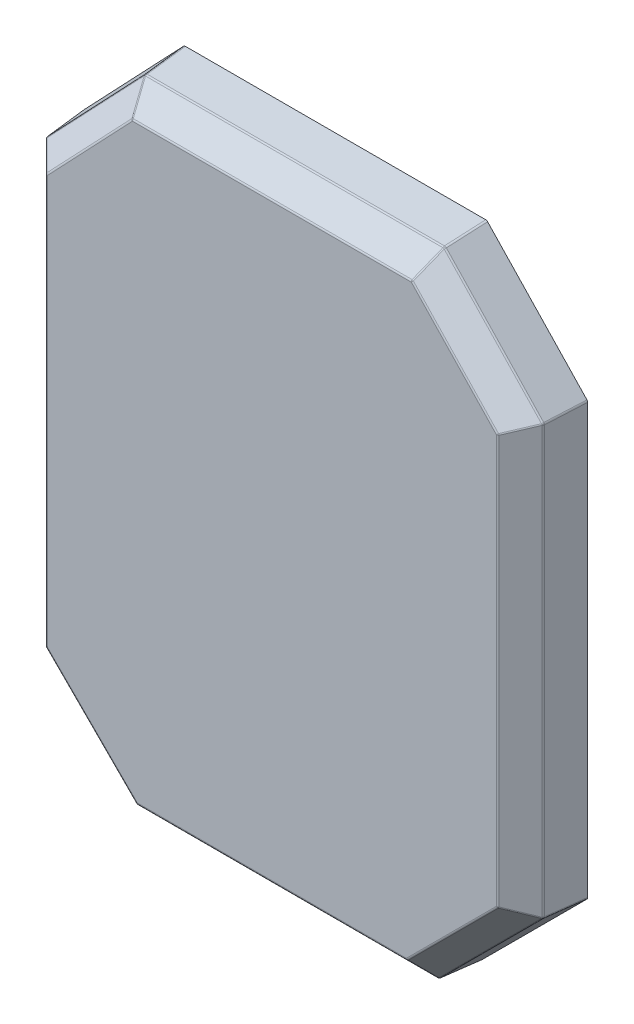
ISO-10303-21;
HEADER;
FILE_DESCRIPTION(('STEP AP214'),'2;1');
FILE_NAME('part.step','',(''),(''),'','','');
FILE_SCHEMA(('AUTOMOTIVE_DESIGN { 1 0 10303 214 1 1 1 1 }'));
ENDSEC;
DATA;
#1=APPLICATION_CONTEXT('core data for automotive mechanical design processes');
#2=APPLICATION_PROTOCOL_DEFINITION('international standard','automotive_design',2000,#1);
#3=PRODUCT_CONTEXT('',#1,'mechanical');
#4=PRODUCT('Part','Part','',(#3));
#5=PRODUCT_RELATED_PRODUCT_CATEGORY('part','',(#4));
#6=PRODUCT_DEFINITION_FORMATION('','',#4);
#7=PRODUCT_DEFINITION_CONTEXT('part definition',#1,'design');
#8=PRODUCT_DEFINITION('design','',#6,#7);
#9=PRODUCT_DEFINITION_SHAPE('','',#8);
#10=(LENGTH_UNIT() NAMED_UNIT(*) SI_UNIT(.MILLI.,.METRE.));
#11=(NAMED_UNIT(*) PLANE_ANGLE_UNIT() SI_UNIT($,.RADIAN.));
#12=(NAMED_UNIT(*) SI_UNIT($,.STERADIAN.) SOLID_ANGLE_UNIT());
#13=UNCERTAINTY_MEASURE_WITH_UNIT(LENGTH_MEASURE(1.E-05),#10,'distance_accuracy_value','');
#14=(GEOMETRIC_REPRESENTATION_CONTEXT(3) GLOBAL_UNCERTAINTY_ASSIGNED_CONTEXT((#13)) GLOBAL_UNIT_ASSIGNED_CONTEXT((#10,
#11,#12)) REPRESENTATION_CONTEXT('',''));
#15=CARTESIAN_POINT('',(0.,0.,0.));
#16=DIRECTION('',(0.,0.,1.));
#17=DIRECTION('',(1.,0.,0.));
#18=AXIS2_PLACEMENT_3D('',#15,#16,#17);
#19=CARTESIAN_POINT('',(47.50000036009,121.1827795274,37.));
#20=DIRECTION('',(0.,0.,-1.));
#21=DIRECTION('',(0.,-1.,0.));
#22=AXIS2_PLACEMENT_3D('',#19,#20,#21);
#23=PLANE('',#22);
#24=CARTESIAN_POINT('',(28.6472814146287,121.02774645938,36.9999999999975));
#25=CARTESIAN_POINT('',(28.6414844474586,121.033848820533,37.0000000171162));
#26=CARTESIAN_POINT('',(28.6355326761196,121.039804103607,37.0000010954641));
#27=CARTESIAN_POINT('',(28.6233360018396,121.051405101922,37.0000046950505));
#28=CARTESIAN_POINT('',(28.6170911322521,121.057050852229,37.000007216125));
#29=CARTESIAN_POINT('',(28.6043240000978,121.06801826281,37.0000130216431));
#30=CARTESIAN_POINT('',(28.5978017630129,121.073339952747,37.0000163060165));
#31=CARTESIAN_POINT('',(28.5844965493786,121.083645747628,37.0000230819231));
#32=CARTESIAN_POINT('',(28.5777135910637,121.088629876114,37.0000265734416));
#33=CARTESIAN_POINT('',(28.5639041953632,121.098247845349,37.0000332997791));
#34=CARTESIAN_POINT('',(28.5568777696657,121.102881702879,37.0000365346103));
#35=CARTESIAN_POINT('',(28.5425993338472,121.111787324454,37.0000423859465));
#36=CARTESIAN_POINT('',(28.5353473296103,121.116059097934,37.0000450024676));
#37=CARTESIAN_POINT('',(28.5206362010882,121.12422965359,37.0000493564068));
#38=CARTESIAN_POINT('',(28.5131770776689,121.128128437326,37.0000510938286));
#39=CARTESIAN_POINT('',(28.4980707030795,121.135543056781,37.0000535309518));
#40=CARTESIAN_POINT('',(28.4904234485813,121.13905888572,37.0000542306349));
#41=CARTESIAN_POINT('',(28.474960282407,121.145698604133,37.0000545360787));
#42=CARTESIAN_POINT('',(28.4671443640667,121.148822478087,37.0000541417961));
#43=CARTESIAN_POINT('',(28.4513637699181,121.154670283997,37.000052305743));
#44=CARTESIAN_POINT('',(28.4433990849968,121.157394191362,37.0000508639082));
#45=CARTESIAN_POINT('',(28.4273412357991,121.162435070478,37.0000470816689));
#46=CARTESIAN_POINT('',(28.419248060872,121.164752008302,37.0000447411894));
#47=CARTESIAN_POINT('',(28.4029538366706,121.168972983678,37.0000394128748));
#48=CARTESIAN_POINT('',(28.3947527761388,121.170876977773,37.0000364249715));
#49=CARTESIAN_POINT('',(28.3782636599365,121.174267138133,37.0000301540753));
#50=CARTESIAN_POINT('',(28.3699755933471,121.17575325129,37.0000268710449));
#51=CARTESIAN_POINT('',(28.3533335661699,121.178303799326,37.0000204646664));
#52=CARTESIAN_POINT('',(28.3449795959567,121.179368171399,37.0000173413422));
#53=CARTESIAN_POINT('',(28.3282270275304,121.18107237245,37.0000118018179));
#54=CARTESIAN_POINT('',(28.3198284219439,121.181712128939,37.0000093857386));
#55=CARTESIAN_POINT('',(28.3030079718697,121.182565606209,37.0000059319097));
#56=CARTESIAN_POINT('',(28.2945861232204,121.182779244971,37.0000048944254));
#57=CARTESIAN_POINT('',(28.2861642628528,121.182779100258,37.000004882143));
#58=B_SPLINE_CURVE_WITH_KNOTS('',3,(#24,#25,#26,#27,#28,#29,#30,#31,#32,#33,#34,#35,#36,#37,#38,
#39,#40,#41,#42,#43,#44,#45,#46,#47,#48,#49,#50,#51,#52,#53,#54,#55,#56,#57),.UNSPECIFIED.,.F.,
.F.,(4,2,2,2,2,2,2,2,2,2,2,2,2,2,2,2,4),(0.,0.0252478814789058,0.0504928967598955,
0.0757355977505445,0.100976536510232,0.126216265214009,0.15145533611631,0.176694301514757,
0.201933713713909,0.227174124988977,0.252416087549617,0.277660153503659,0.302906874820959,
0.328156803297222,0.353410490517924,0.378668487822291,0.403931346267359),.UNSPECIFIED.);
#59=CARTESIAN_POINT('',(28.64728141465,121.0277464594,37.));
#60=VERTEX_POINT('',#59);
#61=CARTESIAN_POINT('',(28.28616426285,121.1827786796,37.00000484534));
#62=VERTEX_POINT('',#61);
#63=EDGE_CURVE('E10',#60,#62,#58,.T.);
#64=ORIENTED_EDGE('',*,*,#63,.F.);
#65=DIRECTION('',(0.688749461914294,-0.724999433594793,0.));
#66=VECTOR('',#65,1.);
#67=CARTESIAN_POINT('',(28.64728141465,121.0277464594,37.));
#68=LINE('',#67,#66);
#69=CARTESIAN_POINT('',(47.3630233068,101.3269655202,37.));
#70=VERTEX_POINT('',#69);
#71=EDGE_CURVE('E1310',#60,#70,#68,.T.);
#72=ORIENTED_EDGE('',*,*,#71,.T.);
#73=CARTESIAN_POINT('',(47.5000003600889,100.9839012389,36.9999999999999));
#74=CARTESIAN_POINT('',(47.5000005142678,100.991787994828,37.000000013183));
#75=CARTESIAN_POINT('',(47.4998132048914,100.999674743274,37.0000008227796));
#76=CARTESIAN_POINT('',(47.4990646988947,101.015429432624,37.0000035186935));
#77=CARTESIAN_POINT('',(47.4985035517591,101.023297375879,37.0000054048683));
#78=CARTESIAN_POINT('',(47.4970084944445,101.038996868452,37.0000097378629));
#79=CARTESIAN_POINT('',(47.4960746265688,101.046828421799,37.0000121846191));
#80=CARTESIAN_POINT('',(47.4938363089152,101.062437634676,37.0000172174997));
#81=CARTESIAN_POINT('',(47.4925318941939,101.070215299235,37.0000198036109));
#82=CARTESIAN_POINT('',(47.4895554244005,101.085699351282,37.0000247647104));
#83=CARTESIAN_POINT('',(47.4878833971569,101.093405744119,37.0000271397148));
#84=CARTESIAN_POINT('',(47.4841754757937,101.108730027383,37.0000314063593));
#85=CARTESIAN_POINT('',(47.4821396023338,101.116347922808,37.0000332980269));
#86=CARTESIAN_POINT('',(47.4777085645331,101.131478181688,37.00003640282));
#87=CARTESIAN_POINT('',(47.475313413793,101.138990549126,37.0000376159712));
#88=CARTESIAN_POINT('',(47.4701691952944,101.153892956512,37.0000392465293));
#89=CARTESIAN_POINT('',(47.4674201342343,101.161282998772,37.0000396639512));
#90=CARTESIAN_POINT('',(47.461574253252,101.17592423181,37.0000396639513));
#91=CARTESIAN_POINT('',(47.4584774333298,101.183175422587,37.0000392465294));
#92=CARTESIAN_POINT('',(47.4519429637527,101.197522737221,37.0000376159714));
#93=CARTESIAN_POINT('',(47.4485053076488,101.20461885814,37.0000364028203));
#94=CARTESIAN_POINT('',(47.4412968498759,101.218640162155,37.0000332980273));
#95=CARTESIAN_POINT('',(47.4375260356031,101.225565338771,37.0000314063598));
#96=CARTESIAN_POINT('',(47.4296596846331,101.239229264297,37.0000271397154));
#97=CARTESIAN_POINT('',(47.4255641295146,101.245968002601,37.0000247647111));
#98=CARTESIAN_POINT('',(47.4170574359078,101.259243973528,37.0000198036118));
#99=CARTESIAN_POINT('',(47.4126462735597,101.265781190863,37.0000172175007));
#100=CARTESIAN_POINT('',(47.4035182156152,101.278639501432,37.0000121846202));
#101=CARTESIAN_POINT('',(47.3988012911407,101.284960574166,37.0000097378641));
#102=CARTESIAN_POINT('',(47.3890721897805,101.297372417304,37.0000054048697));
#103=CARTESIAN_POINT('',(47.3840599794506,101.303463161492,37.0000035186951));
#104=CARTESIAN_POINT('',(47.3737516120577,101.315400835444,37.0000008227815));
#105=CARTESIAN_POINT('',(47.3684554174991,101.321247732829,37.000000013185));
#106=CARTESIAN_POINT('',(47.3630233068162,101.326965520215,37.000000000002));
#107=B_SPLINE_CURVE_WITH_KNOTS('',3,(#73,#74,#75,#76,#77,#78,#79,#80,#81,#82,#83,#84,#85,#86,
#87,#88,#89,#90,#91,#92,#93,#94,#95,#96,#97,#98,#99,#100,#101,#102,#103,#104,#105,#106),
.UNSPECIFIED.,.F.,.F.,(4,2,2,2,2,2,2,2,2,2,2,2,2,2,2,2,4),(0.,0.0236580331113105,
0.0473129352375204,0.0709651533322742,0.0946151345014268,0.118263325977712,0.14191017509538,
0.165556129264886,0.189201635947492,0.212847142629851,0.23649309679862,0.260139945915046,
0.283788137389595,0.307438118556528,0.331090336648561,0.354745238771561,0.378403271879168),.UNSPECIFIED.);
#108=CARTESIAN_POINT('',(47.50000036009,100.9839012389,37.));
#109=VERTEX_POINT('',#108);
#110=EDGE_CURVE('E841',#109,#70,#107,.T.);
#111=ORIENTED_EDGE('',*,*,#110,.F.);
#112=DIRECTION('',(0.,-1.,0.));
#113=VECTOR('',#112,1.);
#114=CARTESIAN_POINT('',(47.50000036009,100.9839012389,37.));
#115=LINE('',#114,#113);
#116=CARTESIAN_POINT('',(47.50000036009,20.20631853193,37.));
#117=VERTEX_POINT('',#116);
#118=EDGE_CURVE('E1301',#109,#117,#115,.T.);
#119=ORIENTED_EDGE('',*,*,#118,.T.);
#120=CARTESIAN_POINT('',(47.3541110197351,19.8541105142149,36.9999999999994));
#121=CARTESIAN_POINT('',(47.3598762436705,19.8598754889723,37.0000000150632));
#122=CARTESIAN_POINT('',(47.3654997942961,19.8657821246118,37.0000009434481));
#123=CARTESIAN_POINT('',(47.376449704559,19.8778631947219,37.0000040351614));
#124=CARTESIAN_POINT('',(47.3817761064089,19.8840375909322,37.0000061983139));
#125=CARTESIAN_POINT('',(47.3921188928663,19.8966395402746,37.0000111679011));
#126=CARTESIAN_POINT('',(47.3971353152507,19.9030670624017,37.0000139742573));
#127=CARTESIAN_POINT('',(47.4068462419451,19.9161598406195,37.000019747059));
#128=CARTESIAN_POINT('',(47.4115407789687,19.9228250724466,37.0000227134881));
#129=CARTESIAN_POINT('',(47.4205967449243,19.9363773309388,37.0000284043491));
#130=CARTESIAN_POINT('',(47.424958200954,19.9432643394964,37.0000311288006));
#131=CARTESIAN_POINT('',(47.4333376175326,19.9572436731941,37.0000360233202));
#132=CARTESIAN_POINT('',(47.4373555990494,19.9643359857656,37.0000381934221));
#133=CARTESIAN_POINT('',(47.445038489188,19.9787089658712,37.0000417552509));
#134=CARTESIAN_POINT('',(47.4487034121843,19.9859896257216,37.0000431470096));
#135=CARTESIAN_POINT('',(47.4556714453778,20.000721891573,37.0000450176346));
#136=CARTESIAN_POINT('',(47.4589745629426,20.0081734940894,37.0000454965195));
#137=CARTESIAN_POINT('',(47.4652111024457,20.0232298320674,37.0000454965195));
#138=CARTESIAN_POINT('',(47.468144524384,20.0308345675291,37.0000450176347));
#139=CARTESIAN_POINT('',(47.4736346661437,20.0461789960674,37.0000431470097));
#140=CARTESIAN_POINT('',(47.4761913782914,20.0539186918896,37.0000417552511));
#141=CARTESIAN_POINT('',(47.4809219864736,20.069514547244,37.0000381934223));
#142=CARTESIAN_POINT('',(47.4830958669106,20.0773707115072,37.0000360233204));
#143=CARTESIAN_POINT('',(47.4870556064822,20.0931807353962,37.0000311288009));
#144=CARTESIAN_POINT('',(47.4888414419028,20.1011346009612,37.0000284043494));
#145=CARTESIAN_POINT('',(47.4920208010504,20.1171210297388,37.0000227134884));
#146=CARTESIAN_POINT('',(47.4934142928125,20.1251535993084,37.0000197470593));
#147=CARTESIAN_POINT('',(47.4958056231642,20.1412782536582,37.0000139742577));
#148=CARTESIAN_POINT('',(47.4968034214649,20.1493703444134,37.0000111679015));
#149=CARTESIAN_POINT('',(47.4984008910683,20.1655947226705,37.0000061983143));
#150=CARTESIAN_POINT('',(47.499000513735,20.1737270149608,37.0000040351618));
#151=CARTESIAN_POINT('',(47.4998003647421,20.1900123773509,37.0000009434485));
#152=CARTESIAN_POINT('',(47.5000005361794,20.1981654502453,37.0000000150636));
#153=CARTESIAN_POINT('',(47.5000003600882,20.20631853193,36.9999999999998));
#154=B_SPLINE_CURVE_WITH_KNOTS('',3,(#120,#121,#122,#123,#124,#125,#126,#127,#128,#129,#130,
#131,#132,#133,#134,#135,#136,#137,#138,#139,#140,#141,#142,#143,#144,#145,#146,#147,#148,#149,
#150,#151,#152,#153),.UNSPECIFIED.,.F.,.F.,(4,2,2,2,2,2,2,2,2,2,2,2,2,2,2,2,4),(0.,
0.0244567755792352,0.048910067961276,0.073360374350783,0.0978081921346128,0.122254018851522,
0.146698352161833,0.171141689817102,0.195584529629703,0.220027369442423,0.244470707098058,
0.268915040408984,0.293360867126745,0.317808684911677,0.342258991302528,0.366712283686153,
0.391169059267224),.UNSPECIFIED.);
#155=CARTESIAN_POINT('',(47.35411101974,19.85411051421,37.));
#156=VERTEX_POINT('',#155);
#157=EDGE_CURVE('E668',#156,#117,#154,.T.);
#158=ORIENTED_EDGE('',*,*,#157,.F.);
#159=DIRECTION('',(-0.707106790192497,-0.707106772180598,0.));
#160=VECTOR('',#159,1.);
#161=CARTESIAN_POINT('',(47.35411101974,19.85411051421,37.));
#162=LINE('',#161,#160);
#163=CARTESIAN_POINT('',(27.64588933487,0.145889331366,37.));
#164=VERTEX_POINT('',#163);
#165=EDGE_CURVE('E1373',#156,#164,#162,.T.);
#166=ORIENTED_EDGE('',*,*,#165,.T.);
#167=CARTESIAN_POINT('',(27.29368132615,8.41340885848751E-13,37.));
#168=CARTESIAN_POINT('',(27.301834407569,-1.76090180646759E-07,37.0000000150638));
#169=CARTESIAN_POINT('',(27.3099874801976,0.000199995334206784,37.0000009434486));
#170=CARTESIAN_POINT('',(27.3262728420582,0.000999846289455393,37.0000040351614));
#171=CARTESIAN_POINT('',(27.3344051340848,0.00159946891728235,37.0000061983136));
#172=CARTESIAN_POINT('',(27.3506295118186,0.00319693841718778,37.0000111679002));
#173=CARTESIAN_POINT('',(27.3587216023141,0.00419473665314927,37.000013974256));
#174=CARTESIAN_POINT('',(27.3748462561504,0.00658606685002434,37.0000197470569));
#175=CARTESIAN_POINT('',(27.3828788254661,0.00797955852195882,37.0000227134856));
#176=CARTESIAN_POINT('',(27.3988652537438,0.011158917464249,37.0000284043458));
#177=CARTESIAN_POINT('',(27.4068191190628,0.0129447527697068,37.0000311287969));
#178=CARTESIAN_POINT('',(27.422629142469,0.0169044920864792,37.0000360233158));
#179=CARTESIAN_POINT('',(27.4304853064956,0.0190783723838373,37.0000381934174));
#180=CARTESIAN_POINT('',(27.4460811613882,0.0238089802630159,37.0000417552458));
#181=CARTESIAN_POINT('',(27.4538208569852,0.0263656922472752,37.0000431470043));
#182=CARTESIAN_POINT('',(27.469165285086,0.0318558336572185,37.000045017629));
#183=CARTESIAN_POINT('',(27.4767700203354,0.0347892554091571,37.0000454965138));
#184=CARTESIAN_POINT('',(27.4918263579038,0.0410257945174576,37.0000454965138));
#185=CARTESIAN_POINT('',(27.4992779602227,0.0443289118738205,37.000045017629));
#186=CARTESIAN_POINT('',(27.5140102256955,0.0512969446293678,37.0000431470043));
#187=CARTESIAN_POINT('',(27.5212908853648,0.0549618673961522,37.0000417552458));
#188=CARTESIAN_POINT('',(27.5356638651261,0.0626447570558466,37.0000381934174));
#189=CARTESIAN_POINT('',(27.5427561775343,0.0666627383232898,37.0000360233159));
#190=CARTESIAN_POINT('',(27.5567355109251,0.0750421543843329,37.000031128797));
#191=CARTESIAN_POINT('',(27.5636225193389,0.0794036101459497,37.0000284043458));
#192=CARTESIAN_POINT('',(27.5771747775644,0.0884595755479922,37.0000227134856));
#193=CARTESIAN_POINT('',(27.5838400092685,0.0931541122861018,37.0000197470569));
#194=CARTESIAN_POINT('',(27.5969327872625,0.102865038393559,37.000013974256));
#195=CARTESIAN_POINT('',(27.6033603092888,0.107881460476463,37.0000111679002));
#196=CARTESIAN_POINT('',(27.6159622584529,0.118224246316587,37.0000061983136));
#197=CARTESIAN_POINT('',(27.6221366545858,0.123550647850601,37.0000040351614));
#198=CARTESIAN_POINT('',(27.6342177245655,0.134500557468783,37.0000009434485));
#199=CARTESIAN_POINT('',(27.6401243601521,0.140124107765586,37.0000000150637));
#200=CARTESIAN_POINT('',(27.6458893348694,0.145889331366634,36.9999999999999));
#201=B_SPLINE_CURVE_WITH_KNOTS('',3,(#167,#168,#169,#170,#171,#172,#173,#174,#175,#176,#177,
#178,#179,#180,#181,#182,#183,#184,#185,#186,#187,#188,#189,#190,#191,#192,#193,#194,#195,#196,
#197,#198,#199,#200),.UNSPECIFIED.,.F.,.F.,(4,2,2,2,2,2,2,2,2,2,2,2,2,2,2,2,4),(0.,
0.0244567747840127,0.0489100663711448,0.0733603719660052,0.0978081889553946,0.122254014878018,
0.146698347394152,0.171141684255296,0.19558452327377,0.220027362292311,0.244470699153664,
0.268915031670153,0.293360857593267,0.317808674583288,0.342258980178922,0.366712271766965,
0.391169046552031),.UNSPECIFIED.);
#202=CARTESIAN_POINT('',(27.29368132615,7.65498775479E-13,37.));
#203=VERTEX_POINT('',#202);
#204=EDGE_CURVE('E1673',#203,#164,#201,.T.);
#205=ORIENTED_EDGE('',*,*,#204,.F.);
#206=DIRECTION('',(-1.,0.,0.));
#207=VECTOR('',#206,1.);
#208=CARTESIAN_POINT('',(27.29368132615,7.65498775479E-13,37.));
#209=LINE('',#208,#207);
#210=CARTESIAN_POINT('',(-27.29368132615,8.364420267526E-13,37.));
#211=VERTEX_POINT('',#210);
#212=EDGE_CURVE('E96',#203,#211,#209,.T.);
#213=ORIENTED_EDGE('',*,*,#212,.T.);
#214=CARTESIAN_POINT('',(-27.29368132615,8.04911692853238E-13,37.));
#215=CARTESIAN_POINT('',(-27.392792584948,8.04911692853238E-13,37.));
#216=CARTESIAN_POINT('',(-27.48429983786,0.037903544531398,37.));
#217=B_SPLINE_CURVE_WITH_KNOTS('',2,(#214,#215,#216),.UNSPECIFIED.,.F.,.F.,(3,3),(0.,1.),.UNSPECIFIED.);
#218=CARTESIAN_POINT('',(-27.48429983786,0.03790354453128,37.));
#219=VERTEX_POINT('',#218);
#220=EDGE_CURVE('E110',#211,#219,#217,.T.);
#221=ORIENTED_EDGE('',*,*,#220,.T.);
#222=CARTESIAN_POINT('',(-27.48429983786,0.037903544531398,37.));
#223=CARTESIAN_POINT('',(-27.5758070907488,0.0758070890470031,37.));
#224=CARTESIAN_POINT('',(-27.64588933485,0.145889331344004,37.));
#225=B_SPLINE_CURVE_WITH_KNOTS('',2,(#222,#223,#224),.UNSPECIFIED.,.F.,.F.,(3,3),(0.,1.),.UNSPECIFIED.);
#226=CARTESIAN_POINT('',(-27.64588933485,0.145889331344,37.));
#227=VERTEX_POINT('',#226);
#228=EDGE_CURVE('E1612',#219,#227,#225,.T.);
#229=ORIENTED_EDGE('',*,*,#228,.T.);
#230=DIRECTION('',(0.707106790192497,-0.707106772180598,0.));
#231=VECTOR('',#230,1.);
#232=CARTESIAN_POINT('',(-47.35411101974,19.85411051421,37.));
#233=LINE('',#232,#231);
#234=CARTESIAN_POINT('',(-47.35411101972,19.8541105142,37.));
#235=VERTEX_POINT('',#234);
#236=EDGE_CURVE('E1463',#235,#227,#233,.T.);
#237=ORIENTED_EDGE('',*,*,#236,.F.);
#238=CARTESIAN_POINT('',(-47.35411101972,19.8541105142,37.));
#239=CARTESIAN_POINT('',(-47.50000036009,19.999999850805,37.));
#240=CARTESIAN_POINT('',(-47.50000036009,20.20631853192,37.));
#241=B_SPLINE_CURVE_WITH_KNOTS('',2,(#238,#239,#240),.UNSPECIFIED.,.F.,.F.,(3,3),(0.,1.),.UNSPECIFIED.);
#242=CARTESIAN_POINT('',(-47.50000036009,20.20631853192,37.));
#243=VERTEX_POINT('',#242);
#244=EDGE_CURVE('E1464',#235,#243,#241,.T.);
#245=ORIENTED_EDGE('',*,*,#244,.T.);
#246=DIRECTION('',(0.,-1.,0.));
#247=VECTOR('',#246,1.);
#248=CARTESIAN_POINT('',(-47.50000036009,100.983901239,37.));
#249=LINE('',#248,#247);
#250=CARTESIAN_POINT('',(-47.50000036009,100.9839012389,37.));
#251=VERTEX_POINT('',#250);
#252=EDGE_CURVE('E1707',#251,#243,#249,.T.);
#253=ORIENTED_EDGE('',*,*,#252,.F.);
#254=CARTESIAN_POINT('',(-47.50000036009,100.9839012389,37.));
#255=CARTESIAN_POINT('',(-47.50000036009,101.182779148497,37.));
#256=CARTESIAN_POINT('',(-47.36302330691,101.3269655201,37.));
#257=B_SPLINE_CURVE_WITH_KNOTS('',2,(#254,#255,#256),.UNSPECIFIED.,.F.,.F.,(3,3),(0.,1.),.UNSPECIFIED.);
#258=CARTESIAN_POINT('',(-47.36302330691,101.3269655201,37.));
#259=VERTEX_POINT('',#258);
#260=EDGE_CURVE('E1552',#251,#259,#257,.T.);
#261=ORIENTED_EDGE('',*,*,#260,.T.);
#262=DIRECTION('',(-0.688749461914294,-0.724999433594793,0.));
#263=VECTOR('',#262,1.);
#264=CARTESIAN_POINT('',(-28.64728141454,121.0277464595,37.));
#265=LINE('',#264,#263);
#266=CARTESIAN_POINT('',(-28.64728141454,121.0277464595,37.));
#267=VERTEX_POINT('',#266);
#268=EDGE_CURVE('E1499',#267,#259,#265,.T.);
#269=ORIENTED_EDGE('',*,*,#268,.F.);
#270=CARTESIAN_POINT('',(-28.64728141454,121.0277464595,37.));
#271=CARTESIAN_POINT('',(-28.5768575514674,121.101876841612,37.));
#272=CARTESIAN_POINT('',(-28.4800258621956,121.143323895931,37.));
#273=CARTESIAN_POINT('',(-28.3865750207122,121.183323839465,37.));
#274=CARTESIAN_POINT('',(-28.28350330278,121.1827754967,37.));
#275=B_SPLINE_CURVE_WITH_KNOTS('',2,(#270,#271,#272,#273,#274),.UNSPECIFIED.,.F.,.F.,(3,2,3),
(0.,0.5,1.),.UNSPECIFIED.);
#276=CARTESIAN_POINT('',(-28.28350330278,121.1827754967,37.0000143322));
#277=VERTEX_POINT('',#276);
#278=EDGE_CURVE('E746',#267,#277,#275,.T.);
#279=ORIENTED_EDGE('',*,*,#278,.T.);
#280=CARTESIAN_POINT('',(-28.28350330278,121.1827754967,37.));
#281=DIRECTION('',(0.999999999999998,5.62651357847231E-08,0.));
#282=VECTOR('',#281,1.);
#283=LINE('',#280,#282);
#284=EDGE_CURVE('E785',#277,#62,#283,.T.);
#285=ORIENTED_EDGE('',*,*,#284,.T.);
#286=EDGE_LOOP('',(#64,#72,#111,#119,#158,#166,#205,#213,#221,#229,#237,#245,#253,#261,#269,
#279,#285));
#287=FACE_BOUND('',#286,.T.);
#288=ADVANCED_FACE('F16',(#287),#23,.T.);
#289=CARTESIAN_POINT('',(26.28330309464,116.0194021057,90.28081736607));
#290=DIRECTION('',(-0.0373907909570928,-0.0870947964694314,0.995498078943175));
#291=DIRECTION('',(-0.722240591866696,-0.68612856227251,-0.0871557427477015));
#292=AXIS2_PLACEMENT_3D('',#289,#290,#291);
#293=CYLINDRICAL_SURFACE('',#292,0.5);
#294=ORIENTED_EDGE('',*,*,#63,.T.);
#295=DIRECTION('',(-0.0373910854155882,-0.0870947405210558,0.995498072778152));
#296=VECTOR('',#295,1.);
#297=CARTESIAN_POINT('',(28.28616426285,121.1827786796,37.00000484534));
#298=LINE('',#297,#296);
#299=CARTESIAN_POINT('',(28.00484296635,120.5274993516,44.48988660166));
#300=VERTEX_POINT('',#299);
#301=EDGE_CURVE('E789',#62,#300,#298,.T.);
#302=ORIENTED_EDGE('',*,*,#301,.T.);
#303=CARTESIAN_POINT('',(28.00484342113,120.0294056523,44.44626709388));
#304=DIRECTION('',(0.037390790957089,0.0870947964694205,-0.995498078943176));
#305=DIRECTION('',(-3.33760796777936E-12,0.996194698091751,0.0871557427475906));
#306=AXIS2_PLACEMENT_3D('',#303,#304,#305);
#307=CIRCLE('',#306,0.5);
#308=CARTESIAN_POINT('',(28.2012022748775,120.486786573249,44.493657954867));
#309=VERTEX_POINT('',#308);
#310=EDGE_CURVE('E803',#300,#309,#307,.T.);
#311=ORIENTED_EDGE('',*,*,#310,.T.);
#312=CARTESIAN_POINT('',(28.00484342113,120.0294056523,44.44626709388));
#313=DIRECTION('',(0.037390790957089,0.0870947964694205,-0.995498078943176));
#314=DIRECTION('',(-3.33760796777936E-12,0.996194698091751,0.0871557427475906));
#315=AXIS2_PLACEMENT_3D('',#312,#313,#314);
#316=CIRCLE('',#315,0.5);
#317=CARTESIAN_POINT('',(28.36596371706,120.3724699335,44.48984496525));
#318=VERTEX_POINT('',#317);
#319=EDGE_CURVE('E792',#309,#318,#316,.T.);
#320=ORIENTED_EDGE('',*,*,#319,.T.);
#321=DIRECTION('',(0.0373907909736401,0.0870947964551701,-0.995498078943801));
#322=VECTOR('',#321,1.);
#323=CARTESIAN_POINT('',(28.36596371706,120.3724699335,44.48984496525));
#324=LINE('',#323,#322);
#325=EDGE_CURVE('E29',#318,#60,#324,.T.);
#326=ORIENTED_EDGE('',*,*,#325,.T.);
#327=EDGE_LOOP('',(#294,#302,#311,#320,#326));
#328=FACE_BOUND('',#327,.T.);
#329=ADVANCED_FACE('F605',(#328),#293,.T.);
#330=CARTESIAN_POINT('',(26.40317271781,123.6964914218,34.58689738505));
#331=DIRECTION('',(-0.722240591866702,-0.686128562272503,-0.0871557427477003));
#332=DIRECTION('',(-0.688749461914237,0.724999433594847,0.));
#333=AXIS2_PLACEMENT_3D('',#330,#331,#332);
#334=PLANE('',#333);
#335=ORIENTED_EDGE('',*,*,#71,.F.);
#336=ORIENTED_EDGE('',*,*,#325,.F.);
#337=DIRECTION('',(-0.688749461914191,0.724999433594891,3.06036581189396E-13));
#338=VECTOR('',#337,1.);
#339=CARTESIAN_POINT('',(46.70774678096,101.0653298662,44.48984496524));
#340=LINE('',#339,#338);
#341=CARTESIAN_POINT('',(46.70774678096,101.0653298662,44.48984496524));
#342=VERTEX_POINT('',#341);
#343=EDGE_CURVE('E1114',#342,#318,#340,.T.);
#344=ORIENTED_EDGE('',*,*,#343,.F.);
#345=DIRECTION('',(-0.0871030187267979,-0.0347780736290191,0.995592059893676));
#346=VECTOR('',#345,1.);
#347=CARTESIAN_POINT('',(47.36302330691,101.3269655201,37.));
#348=LINE('',#347,#346);
#349=EDGE_CURVE('E1758',#70,#342,#348,.T.);
#350=ORIENTED_EDGE('',*,*,#349,.F.);
#351=EDGE_LOOP('',(#335,#336,#344,#350));
#352=FACE_BOUND('',#351,.T.);
#353=ADVANCED_FACE('F615',(#352),#334,.F.);
#354=CARTESIAN_POINT('',(42.33662293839,99.12117069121,90.28081736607));
#355=DIRECTION('',(-0.0871030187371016,-0.0347780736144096,0.995592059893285));
#356=DIRECTION('',(-0.996194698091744,0.,-0.0871557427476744));
#357=AXIS2_PLACEMENT_3D('',#354,#355,#356);
#358=CYLINDRICAL_SURFACE('',#357,0.5);
#359=ORIENTED_EDGE('',*,*,#110,.T.);
#360=ORIENTED_EDGE('',*,*,#349,.T.);
#361=CARTESIAN_POINT('',(46.34662648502,100.7222655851,44.44626709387));
#362=DIRECTION('',(0.0871030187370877,0.0347780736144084,-0.995592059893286));
#363=DIRECTION('',(0.722240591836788,0.686128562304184,0.0871557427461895));
#364=AXIS2_PLACEMENT_3D('',#361,#362,#363);
#365=CIRCLE('',#364,0.5);
#366=CARTESIAN_POINT('',(46.8089339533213,100.906853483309,44.4931617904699));
#367=VERTEX_POINT('',#366);
#368=EDGE_CURVE('E542',#342,#367,#365,.T.);
#369=ORIENTED_EDGE('',*,*,#368,.T.);
#370=CARTESIAN_POINT('',(46.34662648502,100.7222655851,44.44626709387));
#371=DIRECTION('',(0.0871030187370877,0.0347780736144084,-0.995592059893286));
#372=DIRECTION('',(0.722240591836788,0.686128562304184,0.0871557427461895));
#373=AXIS2_PLACEMENT_3D('',#370,#371,#372);
#374=CIRCLE('',#373,0.5);
#375=CARTESIAN_POINT('',(46.84472383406,100.722265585,44.48984496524));
#376=VERTEX_POINT('',#375);
#377=EDGE_CURVE('E813',#367,#376,#374,.T.);
#378=ORIENTED_EDGE('',*,*,#377,.T.);
#379=DIRECTION('',(0.0871030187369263,0.0347780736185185,-0.995592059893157));
#380=VECTOR('',#379,1.);
#381=CARTESIAN_POINT('',(46.84472383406,100.722265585,44.48984496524));
#382=LINE('',#381,#380);
#383=EDGE_CURVE('E1297',#376,#109,#382,.T.);
#384=ORIENTED_EDGE('',*,*,#383,.T.);
#385=EDGE_LOOP('',(#359,#360,#369,#378,#384));
#386=FACE_BOUND('',#385,.T.);
#387=ADVANCED_FACE('F621',(#386),#358,.T.);
#388=CARTESIAN_POINT('',(47.58516571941,11.69053825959,36.02655548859));
#389=DIRECTION('',(-0.996194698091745,0.,-0.0871557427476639));
#390=DIRECTION('',(-0.0871557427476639,0.,0.996194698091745));
#391=AXIS2_PLACEMENT_3D('',#388,#389,#390);
#392=PLANE('',#391);
#393=ORIENTED_EDGE('',*,*,#118,.F.);
#394=ORIENTED_EDGE('',*,*,#383,.F.);
#395=DIRECTION('',(0.,-1.,0.));
#396=VECTOR('',#395,1.);
#397=CARTESIAN_POINT('',(46.84472383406,100.722265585,44.48984496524));
#398=LINE('',#397,#396);
#399=CARTESIAN_POINT('',(46.84472383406,20.47774296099,44.48984496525));
#400=VERTEX_POINT('',#399);
#401=EDGE_CURVE('E546',#376,#400,#398,.T.);
#402=ORIENTED_EDGE('',*,*,#401,.T.);
#403=DIRECTION('',(-0.0870990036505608,0.0360775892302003,0.995546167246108));
#404=VECTOR('',#403,1.);
#405=CARTESIAN_POINT('',(47.50000036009,20.20631853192,37.));
#406=LINE('',#405,#404);
#407=EDGE_CURVE('E1536',#117,#400,#406,.T.);
#408=ORIENTED_EDGE('',*,*,#407,.F.);
#409=EDGE_LOOP('',(#393,#394,#402,#408));
#410=FACE_BOUND('',#409,.T.);
#411=ADVANCED_FACE('F617',(#410),#392,.F.);
#412=CARTESIAN_POINT('',(42.33662293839,22.13874084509,90.28081736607));
#413=DIRECTION('',(-0.0870990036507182,0.0360775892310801,0.995546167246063));
#414=DIRECTION('',(-0.704416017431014,0.704416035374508,-0.0871557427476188));
#415=AXIS2_PLACEMENT_3D('',#412,#413,#414);
#416=CYLINDRICAL_SURFACE('',#415,0.5);
#417=ORIENTED_EDGE('',*,*,#157,.T.);
#418=ORIENTED_EDGE('',*,*,#407,.T.);
#419=CARTESIAN_POINT('',(46.34662648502,20.477742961,44.44626709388));
#420=DIRECTION('',(0.0870990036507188,-0.0360775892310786,-0.995546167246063));
#421=DIRECTION('',(0.996194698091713,-1.03458908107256E-11,0.087155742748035));
#422=AXIS2_PLACEMENT_3D('',#419,#420,#421);
#423=CIRCLE('',#422,0.5);
#424=CARTESIAN_POINT('',(46.8065088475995,20.2872534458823,44.4934047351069));
#425=VERTEX_POINT('',#424);
#426=EDGE_CURVE('E503',#400,#425,#423,.T.);
#427=ORIENTED_EDGE('',*,*,#426,.T.);
#428=CARTESIAN_POINT('',(46.34662648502,20.477742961,44.44626709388));
#429=DIRECTION('',(0.0870990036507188,-0.0360775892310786,-0.995546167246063));
#430=DIRECTION('',(0.996194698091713,-1.03458908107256E-11,0.087155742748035));
#431=AXIS2_PLACEMENT_3D('',#428,#429,#430);
#432=CIRCLE('',#431,0.5);
#433=CARTESIAN_POINT('',(46.69883449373,20.1255349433,44.48984496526));
#434=VERTEX_POINT('',#433);
#435=EDGE_CURVE('E1029',#425,#434,#432,.T.);
#436=ORIENTED_EDGE('',*,*,#435,.T.);
#437=DIRECTION('',(0.0870990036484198,-0.0360775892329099,-0.995546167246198));
#438=VECTOR('',#437,1.);
#439=CARTESIAN_POINT('',(46.69883449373,20.1255349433,44.48984496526));
#440=LINE('',#439,#438);
#441=EDGE_CURVE('E674',#434,#156,#440,.T.);
#442=ORIENTED_EDGE('',*,*,#441,.T.);
#443=EDGE_LOOP('',(#417,#418,#427,#436,#442));
#444=FACE_BOUND('',#443,.T.);
#445=ADVANCED_FACE('F620',(#444),#416,.T.);
#446=CARTESIAN_POINT('',(50.00963115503,22.2063295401,34.54863981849));
#447=DIRECTION('',(-0.704416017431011,0.704416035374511,-0.0871557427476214));
#448=DIRECTION('',(-0.122791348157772,0.,0.992432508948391));
#449=AXIS2_PLACEMENT_3D('',#446,#447,#448);
#450=PLANE('',#449);
#451=ORIENTED_EDGE('',*,*,#165,.F.);
#452=ORIENTED_EDGE('',*,*,#441,.F.);
#453=DIRECTION('',(0.707106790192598,0.707106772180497,0.));
#454=VECTOR('',#453,1.);
#455=CARTESIAN_POINT('',(27.37446491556,0.8011658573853,44.48984496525));
#456=LINE('',#455,#454);
#457=CARTESIAN_POINT('',(27.37446491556,0.8011658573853,44.48984496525));
#458=VERTEX_POINT('',#457);
#459=EDGE_CURVE('E499',#458,#434,#456,.T.);
#460=ORIENTED_EDGE('',*,*,#459,.F.);
#461=DIRECTION('',(-0.0360775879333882,0.0870990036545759,0.995546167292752));
#462=VECTOR('',#461,1.);
#463=CARTESIAN_POINT('',(27.64588933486,0.1458893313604,37.));
#464=LINE('',#463,#462);
#465=EDGE_CURVE('E1242',#164,#458,#464,.T.);
#466=ORIENTED_EDGE('',*,*,#465,.F.);
#467=EDGE_LOOP('',(#451,#452,#460,#466));
#468=FACE_BOUND('',#467,.T.);
#469=ADVANCED_FACE('F629',(#468),#450,.F.);
#470=CARTESIAN_POINT('',(28.69381344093,-2.882120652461,-1.679646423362));
#471=DIRECTION('',(0.0360775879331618,-0.0870990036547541,-0.995546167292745));
#472=DIRECTION('',(-0.704416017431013,0.704416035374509,-0.0871557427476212));
#473=AXIS2_PLACEMENT_3D('',#470,#471,#472);
#474=CYLINDRICAL_SURFACE('',#473,0.5);
#475=ORIENTED_EDGE('',*,*,#204,.T.);
#476=ORIENTED_EDGE('',*,*,#465,.T.);
#477=CARTESIAN_POINT('',(27.02225690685,1.153373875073,44.44626709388));
#478=DIRECTION('',(0.0360775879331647,-0.087099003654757,-0.995546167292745));
#479=DIRECTION('',(0.704416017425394,-0.704416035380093,0.0871557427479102));
#480=AXIS2_PLACEMENT_3D('',#477,#478,#479);
#481=CIRCLE('',#480,0.5);
#482=CARTESIAN_POINT('',(27.2127464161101,0.693491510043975,44.4934047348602));
#483=VERTEX_POINT('',#482);
#484=EDGE_CURVE('E480',#458,#483,#481,.T.);
#485=ORIENTED_EDGE('',*,*,#484,.T.);
#486=CARTESIAN_POINT('',(27.02225690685,1.153373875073,44.44626709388));
#487=DIRECTION('',(0.0360775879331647,-0.087099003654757,-0.995546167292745));
#488=DIRECTION('',(0.704416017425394,-0.704416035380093,0.0871557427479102));
#489=AXIS2_PLACEMENT_3D('',#486,#487,#488);
#490=CIRCLE('',#489,0.5);
#491=CARTESIAN_POINT('',(27.02225690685,0.6552765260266,44.48984496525));
#492=VERTEX_POINT('',#491);
#493=EDGE_CURVE('E504',#483,#492,#490,.T.);
#494=ORIENTED_EDGE('',*,*,#493,.T.);
#495=DIRECTION('',(0.0360775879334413,-0.0870990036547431,-0.995546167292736));
#496=VECTOR('',#495,1.);
#497=CARTESIAN_POINT('',(27.02225690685,0.6552765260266,44.48984496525));
#498=LINE('',#497,#496);
#499=EDGE_CURVE('E1259',#492,#203,#498,.T.);
#500=ORIENTED_EDGE('',*,*,#499,.T.);
#501=EDGE_LOOP('',(#475,#476,#485,#494,#500));
#502=FACE_BOUND('',#501,.T.);
#503=ADVANCED_FACE('F632',(#502),#474,.T.);
#504=CARTESIAN_POINT('',(-27.49999999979,0.671137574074,44.67113757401));
#505=DIRECTION('',(0.,-0.996194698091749,0.0871557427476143));
#506=DIRECTION('',(-1.,0.,0.));
#507=AXIS2_PLACEMENT_3D('',#504,#505,#506);
#508=PLANE('',#507);
#509=ORIENTED_EDGE('',*,*,#212,.F.);
#510=ORIENTED_EDGE('',*,*,#499,.F.);
#511=DIRECTION('',(-1.,0.,0.));
#512=VECTOR('',#511,1.);
#513=CARTESIAN_POINT('',(27.02225690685,0.6552765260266,44.48984496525));
#514=LINE('',#513,#512);
#515=CARTESIAN_POINT('',(-27.02225690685,0.6552765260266,44.48984496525));
#516=VERTEX_POINT('',#515);
#517=EDGE_CURVE('E468',#492,#516,#514,.T.);
#518=ORIENTED_EDGE('',*,*,#517,.T.);
#519=DIRECTION('',(0.0360775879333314,0.0870990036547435,0.99554616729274));
#520=VECTOR('',#519,1.);
#521=CARTESIAN_POINT('',(-27.29368132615,7.650546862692E-13,37.));
#522=LINE('',#521,#520);
#523=EDGE_CURVE('E1260',#211,#516,#522,.T.);
#524=ORIENTED_EDGE('',*,*,#523,.F.);
#525=EDGE_LOOP('',(#509,#510,#518,#524));
#526=FACE_BOUND('',#525,.T.);
#527=ADVANCED_FACE('F18',(#526),#508,.T.);
#528=CARTESIAN_POINT('',(-28.69381344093,-2.882120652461,-1.679646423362));
#529=DIRECTION('',(0.0360775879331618,0.0870990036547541,0.995546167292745));
#530=DIRECTION('',(0.704416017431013,0.704416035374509,-0.0871557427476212));
#531=AXIS2_PLACEMENT_3D('',#528,#529,#530);
#532=CYLINDRICAL_SURFACE('',#531,0.5);
#533=ORIENTED_EDGE('',*,*,#228,.F.);
#534=ORIENTED_EDGE('',*,*,#220,.F.);
#535=ORIENTED_EDGE('',*,*,#523,.T.);
#536=CARTESIAN_POINT('',(-27.02225690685,1.153373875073,44.44626709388));
#537=DIRECTION('',(-0.0360775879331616,-0.0870990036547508,-0.995546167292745));
#538=DIRECTION('',(9.43689570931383E-13,-0.996194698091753,0.0871557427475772));
#539=AXIS2_PLACEMENT_3D('',#536,#537,#538);
#540=CIRCLE('',#539,0.5);
#541=CARTESIAN_POINT('',(-27.2127464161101,0.693491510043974,44.4934047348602));
#542=VERTEX_POINT('',#541);
#543=EDGE_CURVE('E469',#516,#542,#540,.T.);
#544=ORIENTED_EDGE('',*,*,#543,.T.);
#545=CARTESIAN_POINT('',(-27.02225690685,1.153373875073,44.44626709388));
#546=DIRECTION('',(-0.0360775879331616,-0.0870990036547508,-0.995546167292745));
#547=DIRECTION('',(9.43689570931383E-13,-0.996194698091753,0.0871557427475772));
#548=AXIS2_PLACEMENT_3D('',#545,#546,#547);
#549=CIRCLE('',#548,0.5);
#550=CARTESIAN_POINT('',(-27.37446491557,0.8011658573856,44.48984496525));
#551=VERTEX_POINT('',#550);
#552=EDGE_CURVE('E969',#542,#551,#549,.T.);
#553=ORIENTED_EDGE('',*,*,#552,.T.);
#554=DIRECTION('',(-0.0360775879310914,-0.0870990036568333,-0.995546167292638));
#555=VECTOR('',#554,1.);
#556=CARTESIAN_POINT('',(-27.37446491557,0.8011658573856,44.48984496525));
#557=LINE('',#556,#555);
#558=EDGE_CURVE('E1607',#551,#227,#557,.T.);
#559=ORIENTED_EDGE('',*,*,#558,.T.);
#560=EDGE_LOOP('',(#533,#534,#535,#544,#553,#559));
#561=FACE_BOUND('',#560,.T.);
#562=ADVANCED_FACE('F1965',(#561),#532,.T.);
#563=CARTESIAN_POINT('',(-50.00963115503,22.2063295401,34.54863981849));
#564=DIRECTION('',(-0.704416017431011,-0.704416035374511,0.0871557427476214));
#565=DIRECTION('',(-0.707106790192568,0.707106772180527,0.));
#566=AXIS2_PLACEMENT_3D('',#563,#564,#565);
#567=PLANE('',#566);
#568=ORIENTED_EDGE('',*,*,#236,.T.);
#569=ORIENTED_EDGE('',*,*,#558,.F.);
#570=DIRECTION('',(0.707106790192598,-0.707106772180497,0.));
#571=VECTOR('',#570,1.);
#572=CARTESIAN_POINT('',(-46.69883449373,20.1255349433,44.48984496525));
#573=LINE('',#572,#571);
#574=CARTESIAN_POINT('',(-46.69883449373,20.1255349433,44.48984496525));
#575=VERTEX_POINT('',#574);
#576=EDGE_CURVE('E487',#575,#551,#573,.T.);
#577=ORIENTED_EDGE('',*,*,#576,.F.);
#578=DIRECTION('',(0.0870990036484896,0.0360775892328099,0.995546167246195));
#579=VECTOR('',#578,1.);
#580=CARTESIAN_POINT('',(-47.35411101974,19.85411051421,37.));
#581=LINE('',#580,#579);
#582=EDGE_CURVE('E1459',#235,#575,#581,.T.);
#583=ORIENTED_EDGE('',*,*,#582,.F.);
#584=EDGE_LOOP('',(#568,#569,#577,#583));
#585=FACE_BOUND('',#584,.T.);
#586=ADVANCED_FACE('F1960',(#585),#567,.T.);
#587=CARTESIAN_POINT('',(-42.33662293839,22.13874084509,90.28081736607));
#588=DIRECTION('',(-0.0870990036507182,-0.0360775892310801,-0.995546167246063));
#589=DIRECTION('',(0.704416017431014,0.704416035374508,-0.0871557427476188));
#590=AXIS2_PLACEMENT_3D('',#587,#588,#589);
#591=CYLINDRICAL_SURFACE('',#590,0.5);
#592=ORIENTED_EDGE('',*,*,#244,.F.);
#593=ORIENTED_EDGE('',*,*,#582,.T.);
#594=CARTESIAN_POINT('',(-46.34662648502,20.477742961,44.44626709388));
#595=DIRECTION('',(-0.0870990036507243,-0.0360775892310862,-0.995546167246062));
#596=DIRECTION('',(-0.704416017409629,-0.704416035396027,0.0871557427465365));
#597=AXIS2_PLACEMENT_3D('',#594,#595,#596);
#598=CIRCLE('',#597,0.5);
#599=CARTESIAN_POINT('',(-46.8065088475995,20.2872534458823,44.4934047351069));
#600=VERTEX_POINT('',#599);
#601=EDGE_CURVE('E508',#575,#600,#598,.T.);
#602=ORIENTED_EDGE('',*,*,#601,.T.);
#603=CARTESIAN_POINT('',(-46.34662648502,20.477742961,44.44626709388));
#604=DIRECTION('',(-0.0870990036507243,-0.0360775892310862,-0.995546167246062));
#605=DIRECTION('',(-0.704416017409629,-0.704416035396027,0.0871557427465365));
#606=AXIS2_PLACEMENT_3D('',#603,#604,#605);
#607=CIRCLE('',#606,0.5);
#608=CARTESIAN_POINT('',(-46.84472383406,20.47774296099,44.48984496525));
#609=VERTEX_POINT('',#608);
#610=EDGE_CURVE('E562',#600,#609,#607,.T.);
#611=ORIENTED_EDGE('',*,*,#610,.T.);
#612=DIRECTION('',(-0.0870990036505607,-0.0360775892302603,-0.995546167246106));
#613=VECTOR('',#612,1.);
#614=CARTESIAN_POINT('',(-46.84472383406,20.47774296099,44.48984496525));
#615=LINE('',#614,#613);
#616=EDGE_CURVE('E1551',#609,#243,#615,.T.);
#617=ORIENTED_EDGE('',*,*,#616,.T.);
#618=EDGE_LOOP('',(#592,#593,#602,#611,#617));
#619=FACE_BOUND('',#618,.T.);
#620=ADVANCED_FACE('F1964',(#619),#591,.T.);
#621=CARTESIAN_POINT('',(-47.58516571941,11.69053825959,36.02655548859));
#622=DIRECTION('',(-0.996194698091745,0.,0.087155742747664));
#623=DIRECTION('',(0.,1.,0.));
#624=AXIS2_PLACEMENT_3D('',#621,#622,#623);
#625=PLANE('',#624);
#626=ORIENTED_EDGE('',*,*,#616,.F.);
#627=DIRECTION('',(0.,1.,0.));
#628=VECTOR('',#627,1.);
#629=CARTESIAN_POINT('',(-46.84472383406,20.47774296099,44.48984496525));
#630=LINE('',#629,#628);
#631=CARTESIAN_POINT('',(-46.84472383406,100.7222655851,44.48984496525));
#632=VERTEX_POINT('',#631);
#633=EDGE_CURVE('E931',#609,#632,#630,.T.);
#634=ORIENTED_EDGE('',*,*,#633,.T.);
#635=DIRECTION('',(0.0871030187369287,-0.0347780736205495,0.995592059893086));
#636=VECTOR('',#635,1.);
#637=CARTESIAN_POINT('',(-47.50000036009,100.983901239,37.));
#638=LINE('',#637,#636);
#639=EDGE_CURVE('E1547',#251,#632,#638,.T.);
#640=ORIENTED_EDGE('',*,*,#639,.F.);
#641=ORIENTED_EDGE('',*,*,#252,.T.);
#642=EDGE_LOOP('',(#626,#634,#640,#641));
#643=FACE_BOUND('',#642,.T.);
#644=ADVANCED_FACE('F2117',(#643),#625,.T.);
#645=CARTESIAN_POINT('',(-42.33662293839,99.12117069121,90.28081736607));
#646=DIRECTION('',(-0.0871030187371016,0.0347780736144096,-0.995592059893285));
#647=DIRECTION('',(0.996194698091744,0.,-0.0871557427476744));
#648=AXIS2_PLACEMENT_3D('',#645,#646,#647);
#649=CYLINDRICAL_SURFACE('',#648,0.5);
#650=ORIENTED_EDGE('',*,*,#260,.F.);
#651=ORIENTED_EDGE('',*,*,#639,.T.);
#652=CARTESIAN_POINT('',(-46.34662648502,100.7222655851,44.44626709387));
#653=DIRECTION('',(-0.0871030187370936,0.0347780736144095,-0.995592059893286));
#654=DIRECTION('',(-0.996194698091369,1.23928645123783E-10,0.0871557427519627));
#655=AXIS2_PLACEMENT_3D('',#652,#653,#654);
#656=CIRCLE('',#655,0.5);
#657=CARTESIAN_POINT('',(-46.8089339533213,100.906853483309,44.4931617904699));
#658=VERTEX_POINT('',#657);
#659=EDGE_CURVE('E908',#632,#658,#656,.T.);
#660=ORIENTED_EDGE('',*,*,#659,.T.);
#661=CARTESIAN_POINT('',(-46.34662648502,100.7222655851,44.44626709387));
#662=DIRECTION('',(-0.0871030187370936,0.0347780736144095,-0.995592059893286));
#663=DIRECTION('',(-0.996194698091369,1.23928645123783E-10,0.0871557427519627));
#664=AXIS2_PLACEMENT_3D('',#661,#662,#663);
#665=CIRCLE('',#664,0.5);
#666=CARTESIAN_POINT('',(-46.70774678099,101.0653298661,44.48984496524));
#667=VERTEX_POINT('',#666);
#668=EDGE_CURVE('E936',#658,#667,#665,.T.);
#669=ORIENTED_EDGE('',*,*,#668,.T.);
#670=DIRECTION('',(-0.0871030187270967,0.0347780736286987,-0.995592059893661));
#671=VECTOR('',#670,1.);
#672=CARTESIAN_POINT('',(-46.70774678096,101.0653298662,44.48984496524));
#673=LINE('',#672,#671);
#674=EDGE_CURVE('E1729',#667,#259,#673,.T.);
#675=ORIENTED_EDGE('',*,*,#674,.T.);
#676=EDGE_LOOP('',(#650,#651,#660,#669,#675));
#677=FACE_BOUND('',#676,.T.);
#678=ADVANCED_FACE('F652',(#677),#649,.T.);
#679=CARTESIAN_POINT('',(-26.40317271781,123.6964914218,34.58689738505));
#680=DIRECTION('',(-0.722240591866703,0.686128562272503,0.0871557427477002));
#681=DIRECTION('',(0.119804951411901,0.,0.992797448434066));
#682=AXIS2_PLACEMENT_3D('',#679,#680,#681);
#683=PLANE('',#682);
#684=ORIENTED_EDGE('',*,*,#268,.T.);
#685=ORIENTED_EDGE('',*,*,#674,.F.);
#686=DIRECTION('',(-0.688749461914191,-0.724999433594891,-3.02834803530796E-13));
#687=VECTOR('',#686,1.);
#688=CARTESIAN_POINT('',(-28.36596371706,120.3724699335,44.48984496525));
#689=LINE('',#688,#687);
#690=CARTESIAN_POINT('',(-28.36596371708,120.3724699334,44.48984496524));
#691=VERTEX_POINT('',#690);
#692=EDGE_CURVE('E557',#691,#667,#689,.T.);
#693=ORIENTED_EDGE('',*,*,#692,.F.);
#694=DIRECTION('',(0.0373907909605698,-0.0870947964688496,0.995498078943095));
#695=VECTOR('',#694,1.);
#696=CARTESIAN_POINT('',(-28.64728141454,121.0277464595,37.));
#697=LINE('',#696,#695);
#698=EDGE_CURVE('E751',#267,#691,#697,.T.);
#699=ORIENTED_EDGE('',*,*,#698,.F.);
#700=EDGE_LOOP('',(#684,#685,#693,#699));
#701=FACE_BOUND('',#700,.T.);
#702=ADVANCED_FACE('F764',(#701),#683,.T.);
#703=CARTESIAN_POINT('',(-26.28330309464,116.0194021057,90.28081736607));
#704=DIRECTION('',(-0.0373907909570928,0.0870947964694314,-0.995498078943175));
#705=DIRECTION('',(0.722240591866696,-0.68612856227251,-0.0871557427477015));
#706=AXIS2_PLACEMENT_3D('',#703,#704,#705);
#707=CYLINDRICAL_SURFACE('',#706,0.5);
#708=ORIENTED_EDGE('',*,*,#278,.F.);
#709=ORIENTED_EDGE('',*,*,#698,.T.);
#710=CARTESIAN_POINT('',(-28.00484342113,120.0294056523,44.44626709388));
#711=DIRECTION('',(-0.0373907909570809,0.08709479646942,-0.995498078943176));
#712=DIRECTION('',(-0.722240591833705,0.686128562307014,0.0871557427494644));
#713=AXIS2_PLACEMENT_3D('',#710,#711,#712);
#714=CIRCLE('',#713,0.5);
#715=CARTESIAN_POINT('',(-28.2012022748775,120.486786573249,44.493657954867));
#716=VERTEX_POINT('',#715);
#717=EDGE_CURVE('E558',#691,#716,#714,.T.);
#718=ORIENTED_EDGE('',*,*,#717,.T.);
#719=CARTESIAN_POINT('',(-28.00484342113,120.0294056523,44.44626709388));
#720=DIRECTION('',(-0.0373907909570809,0.08709479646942,-0.995498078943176));
#721=DIRECTION('',(-0.722240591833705,0.686128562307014,0.0871557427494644));
#722=AXIS2_PLACEMENT_3D('',#719,#720,#721);
#723=CIRCLE('',#722,0.5);
#724=CARTESIAN_POINT('',(-28.00484342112,120.5275030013,44.48984496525));
#725=VERTEX_POINT('',#724);
#726=EDGE_CURVE('E907',#716,#725,#723,.T.);
#727=ORIENTED_EDGE('',*,*,#726,.T.);
#728=DIRECTION('',(-0.0370380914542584,0.0870955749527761,-0.995511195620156));
#729=VECTOR('',#728,1.);
#730=CARTESIAN_POINT('',(-28.00484342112,120.5275030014,44.48984496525));
#731=LINE('',#730,#729);
#732=EDGE_CURVE('E787',#725,#277,#731,.T.);
#733=ORIENTED_EDGE('',*,*,#732,.T.);
#734=EDGE_LOOP('',(#708,#709,#718,#727,#733));
#735=FACE_BOUND('',#734,.T.);
#736=ADVANCED_FACE('F753',(#735),#707,.T.);
#737=CARTESIAN_POINT('',(-28.5,121.1827795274,37.));
#738=DIRECTION('',(0.,0.99619469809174,0.0871557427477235));
#739=DIRECTION('',(1.,0.,0.));
#740=AXIS2_PLACEMENT_3D('',#737,#738,#739);
#741=PLANE('',#740);
#742=ORIENTED_EDGE('',*,*,#284,.F.);
#743=ORIENTED_EDGE('',*,*,#732,.F.);
#744=DIRECTION('',(0.999999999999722,-6.51624565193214E-08,7.43378682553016E-07));
#745=VECTOR('',#744,1.);
#746=CARTESIAN_POINT('',(-28.00484342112,120.5275030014,44.48984496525));
#747=LINE('',#746,#745);
#748=EDGE_CURVE('E597',#725,#300,#747,.T.);
#749=ORIENTED_EDGE('',*,*,#748,.T.);
#750=ORIENTED_EDGE('',*,*,#301,.F.);
#751=EDGE_LOOP('',(#742,#743,#749,#750));
#752=FACE_BOUND('',#751,.T.);
#753=ADVANCED_FACE('F763',(#752),#741,.T.);
#754=CARTESIAN_POINT('',(28.00484342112,120.0294056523,44.44626709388));
#755=DIRECTION('',(0.918898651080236,-0.39449368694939,-1.03297361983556E-13));
#756=DIRECTION('',(0.3532624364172,0.8228582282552,0.445095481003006));
#757=AXIS2_PLACEMENT_3D('',#754,#755,#756);
#758=SPHERICAL_SURFACE('',#757,0.5);
#759=CARTESIAN_POINT('',(28.00484342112,120.0294056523,44.44626709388));
#760=DIRECTION('',(-0.918898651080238,0.394493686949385,1.03334008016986E-13));
#761=DIRECTION('',(-0.394493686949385,-0.918898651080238,0.));
#762=AXIS2_PLACEMENT_3D('',#759,#760,#761);
#763=CIRCLE('',#762,0.5);
#764=CARTESIAN_POINT('',(28.1383040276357,120.340276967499,44.8144345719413));
#765=VERTEX_POINT('',#764);
#766=EDGE_CURVE('E541',#765,#309,#763,.T.);
#767=ORIENTED_EDGE('',*,*,#766,.F.);
#768=CARTESIAN_POINT('',(28.00484342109,120.0294056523,44.44626709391));
#769=DIRECTION('',(-0.290479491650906,-0.676617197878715,0.676617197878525));
#770=DIRECTION('',(0.266921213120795,0.621742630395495,0.736334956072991));
#771=AXIS2_PLACEMENT_3D('',#768,#769,#770);
#772=CIRCLE('',#771,0.5);
#773=CARTESIAN_POINT('',(28.26116942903,120.2729153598,44.79982048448));
#774=VERTEX_POINT('',#773);
#775=EDGE_CURVE('E818',#774,#765,#772,.T.);
#776=ORIENTED_EDGE('',*,*,#775,.F.);
#777=CARTESIAN_POINT('',(28.00484342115,120.0294056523,44.44626709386));
#778=DIRECTION('',(0.688749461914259,-0.724999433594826,0.));
#779=DIRECTION('',(0.722240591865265,0.686128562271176,0.0871557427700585));
#780=AXIS2_PLACEMENT_3D('',#777,#778,#779);
#781=CIRCLE('',#780,0.5);
#782=EDGE_CURVE('E917',#318,#774,#781,.T.);
#783=ORIENTED_EDGE('',*,*,#782,.F.);
#784=ORIENTED_EDGE('',*,*,#319,.F.);
#785=EDGE_LOOP('',(#767,#776,#783,#784));
#786=FACE_BOUND('',#785,.T.);
#787=ADVANCED_FACE('F774',(#786),#758,.T.);
#788=CARTESIAN_POINT('',(27.76157051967,120.2854823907,44.44626709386));
#789=DIRECTION('',(-0.688749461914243,0.724999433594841,0.));
#790=DIRECTION('',(-0.512652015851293,-0.487019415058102,-0.707106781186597));
#791=AXIS2_PLACEMENT_3D('',#788,#789,#790);
#792=CYLINDRICAL_SURFACE('',#791,0.5);
#793=ORIENTED_EDGE('',*,*,#343,.T.);
#794=ORIENTED_EDGE('',*,*,#782,.T.);
#795=DIRECTION('',(0.688749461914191,-0.724999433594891,-2.92695840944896E-13));
#796=VECTOR('',#795,1.);
#797=CARTESIAN_POINT('',(28.26116942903,120.2729153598,44.79982048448));
#798=LINE('',#797,#796);
#799=CARTESIAN_POINT('',(46.60295249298,100.9657752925,44.79982048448));
#800=VERTEX_POINT('',#799);
#801=EDGE_CURVE('E1011',#774,#800,#798,.T.);
#802=ORIENTED_EDGE('',*,*,#801,.T.);
#803=CARTESIAN_POINT('',(46.34662648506,100.722265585,44.44626709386));
#804=DIRECTION('',(-0.688749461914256,0.724999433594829,0.));
#805=DIRECTION('',(0.51265201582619,0.48701941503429,0.707106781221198));
#806=AXIS2_PLACEMENT_3D('',#803,#804,#805);
#807=CIRCLE('',#806,0.5);
#808=EDGE_CURVE('E545',#800,#342,#807,.T.);
#809=ORIENTED_EDGE('',*,*,#808,.T.);
#810=EDGE_LOOP('',(#793,#794,#802,#809));
#811=FACE_BOUND('',#810,.T.);
#812=ADVANCED_FACE('F781',(#811),#792,.T.);
#813=CARTESIAN_POINT('',(46.34662648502,100.722265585,44.44626709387));
#814=DIRECTION('',(-0.370810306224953,0.928708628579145,0.));
#815=DIRECTION('',(0.832938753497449,0.33257177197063,0.442277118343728));
#816=AXIS2_PLACEMENT_3D('',#813,#814,#815);
#817=SPHERICAL_SURFACE('',#816,0.5);
#818=CARTESIAN_POINT('',(46.34662648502,100.722265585,44.44626709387));
#819=DIRECTION('',(0.370810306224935,-0.928708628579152,0.));
#820=DIRECTION('',(0.928708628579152,0.370810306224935,0.));
#821=AXIS2_PLACEMENT_3D('',#818,#819,#820);
#822=CIRCLE('',#821,0.5);
#823=CARTESIAN_POINT('',(46.6626219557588,100.848434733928,44.8126387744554));
#824=VERTEX_POINT('',#823);
#825=EDGE_CURVE('E961',#367,#824,#822,.T.);
#826=ORIENTED_EDGE('',*,*,#825,.F.);
#827=ORIENTED_EDGE('',*,*,#368,.F.);
#828=ORIENTED_EDGE('',*,*,#808,.F.);
#829=CARTESIAN_POINT('',(46.34662648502,100.722265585,44.44626709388));
#830=DIRECTION('',(-0.680505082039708,-0.271708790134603,0.680505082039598));
#831=DIRECTION('',(0.631990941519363,0.252338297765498,0.73274336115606));
#832=AXIS2_PLACEMENT_3D('',#829,#830,#831);
#833=CIRCLE('',#832,0.5);
#834=EDGE_CURVE('E497',#824,#800,#833,.T.);
#835=ORIENTED_EDGE('',*,*,#834,.F.);
#836=EDGE_LOOP('',(#826,#827,#828,#835));
#837=FACE_BOUND('',#836,.T.);
#838=ADVANCED_FACE('F2096',(#837),#817,.T.);
#839=CARTESIAN_POINT('',(46.34662648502,101.0171596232,44.44626709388));
#840=DIRECTION('',(0.,1.,0.));
#841=DIRECTION('',(-0.707106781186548,0.,-0.707106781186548));
#842=AXIS2_PLACEMENT_3D('',#839,#840,#841);
#843=CYLINDRICAL_SURFACE('',#842,0.5);
#844=ORIENTED_EDGE('',*,*,#401,.F.);
#845=CARTESIAN_POINT('',(46.34662648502,100.722265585,44.44626709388));
#846=DIRECTION('',(0.,-1.,0.));
#847=DIRECTION('',(0.996194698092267,0.,0.0871557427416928));
#848=AXIS2_PLACEMENT_3D('',#845,#846,#847);
#849=CIRCLE('',#848,0.5);
#850=CARTESIAN_POINT('',(46.70017987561,100.722265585,44.79982048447));
#851=VERTEX_POINT('',#850);
#852=EDGE_CURVE('E1056',#376,#851,#849,.T.);
#853=ORIENTED_EDGE('',*,*,#852,.T.);
#854=DIRECTION('',(2.41822388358E-13,1.,-2.346500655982E-13));
#855=VECTOR('',#854,1.);
#856=CARTESIAN_POINT('',(46.70017987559,20.47774296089,44.79982048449));
#857=LINE('',#856,#855);
#858=CARTESIAN_POINT('',(46.70017987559,20.47774296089,44.79982048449));
#859=VERTEX_POINT('',#858);
#860=EDGE_CURVE('E494',#859,#851,#857,.T.);
#861=ORIENTED_EDGE('',*,*,#860,.F.);
#862=CARTESIAN_POINT('',(46.34662648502,20.47774296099,44.44626709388));
#863=DIRECTION('',(0.,1.,0.));
#864=DIRECTION('',(0.707106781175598,0.,0.707106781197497));
#865=AXIS2_PLACEMENT_3D('',#862,#863,#864);
#866=CIRCLE('',#865,0.5);
#867=EDGE_CURVE('E565',#859,#400,#866,.T.);
#868=ORIENTED_EDGE('',*,*,#867,.T.);
#869=EDGE_LOOP('',(#844,#853,#861,#868));
#870=FACE_BOUND('',#869,.T.);
#871=ADVANCED_FACE('F1940',(#870),#843,.T.);
#872=CARTESIAN_POINT('',(46.34662648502,20.47774296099,44.44626709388));
#873=DIRECTION('',(0.382683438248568,0.92387953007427,0.));
#874=DIRECTION('',(0.827975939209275,-0.342958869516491,0.44366097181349));
#875=AXIS2_PLACEMENT_3D('',#872,#873,#874);
#876=SPHERICAL_SURFACE('',#875,0.5);
#877=CARTESIAN_POINT('',(46.34662648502,20.47774296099,44.44626709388));
#878=DIRECTION('',(-0.382683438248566,-0.923879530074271,0.));
#879=DIRECTION('',(0.923879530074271,-0.382683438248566,0.));
#880=AXIS2_PLACEMENT_3D('',#877,#878,#879);
#881=CIRCLE('',#880,0.5);
#882=CARTESIAN_POINT('',(46.6600980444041,20.3478987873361,44.8135218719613));
#883=VERTEX_POINT('',#882);
#884=EDGE_CURVE('E522',#425,#883,#881,.T.);
#885=ORIENTED_EDGE('',*,*,#884,.F.);
#886=ORIENTED_EDGE('',*,*,#426,.F.);
#887=ORIENTED_EDGE('',*,*,#867,.F.);
#888=CARTESIAN_POINT('',(46.34662648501,20.47774296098,44.44626709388));
#889=DIRECTION('',(-0.678598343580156,0.281084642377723,0.678598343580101));
#890=DIRECTION('',(0.626943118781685,-0.259688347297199,0.734509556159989));
#891=AXIS2_PLACEMENT_3D('',#888,#889,#890);
#892=CIRCLE('',#891,0.5);
#893=EDGE_CURVE('E1049',#883,#859,#892,.T.);
#894=ORIENTED_EDGE('',*,*,#893,.F.);
#895=EDGE_LOOP('',(#885,#886,#887,#894));
#896=FACE_BOUND('',#895,.T.);
#897=ADVANCED_FACE('F1935',(#896),#876,.T.);
#898=CARTESIAN_POINT('',(46.69002178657,20.8211382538,44.44626709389));
#899=DIRECTION('',(0.707106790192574,0.707106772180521,2.55656606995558E-13));
#900=DIRECTION('',(-0.499999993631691,0.500000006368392,-0.707106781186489));
#901=AXIS2_PLACEMENT_3D('',#898,#899,#900);
#902=CYLINDRICAL_SURFACE('',#901,0.5);
#903=ORIENTED_EDGE('',*,*,#459,.T.);
#904=CARTESIAN_POINT('',(46.34662648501,20.47774296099,44.44626709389));
#905=DIRECTION('',(-0.707106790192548,-0.707106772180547,-2.82607270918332E-13));
#906=DIRECTION('',(0.704416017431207,-0.704416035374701,0.0871557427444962));
#907=AXIS2_PLACEMENT_3D('',#904,#905,#906);
#908=CIRCLE('',#907,0.5);
#909=CARTESIAN_POINT('',(46.59662648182,20.22774295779,44.79982048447));
#910=VERTEX_POINT('',#909);
#911=EDGE_CURVE('E484',#434,#910,#908,.T.);
#912=ORIENTED_EDGE('',*,*,#911,.T.);
#913=DIRECTION('',(-0.707106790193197,-0.707106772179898,7.18894253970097E-13));
#914=VECTOR('',#913,1.);
#915=CARTESIAN_POINT('',(46.59662648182,20.22774295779,44.79982048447));
#916=LINE('',#915,#914);
#917=CARTESIAN_POINT('',(27.27225690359,0.9033738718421,44.79982048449));
#918=VERTEX_POINT('',#917);
#919=EDGE_CURVE('E337',#910,#918,#916,.T.);
#920=ORIENTED_EDGE('',*,*,#919,.T.);
#921=CARTESIAN_POINT('',(27.02225690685,1.153373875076,44.44626709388));
#922=DIRECTION('',(0.707106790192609,0.707106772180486,3.05838687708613E-13));
#923=DIRECTION('',(0.499999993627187,-0.500000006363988,0.707106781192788));
#924=AXIS2_PLACEMENT_3D('',#921,#922,#923);
#925=CIRCLE('',#924,0.5);
#926=EDGE_CURVE('E1007',#918,#458,#925,.T.);
#927=ORIENTED_EDGE('',*,*,#926,.T.);
#928=EDGE_LOOP('',(#903,#912,#920,#927));
#929=FACE_BOUND('',#928,.T.);
#930=ADVANCED_FACE('F1939',(#929),#902,.T.);
#931=CARTESIAN_POINT('',(27.02225690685,1.153373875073,44.44626709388));
#932=DIRECTION('',(-0.923879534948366,-0.382683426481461,0.));
#933=DIRECTION('',(0.342958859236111,-0.82797594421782,0.443660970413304));
#934=AXIS2_PLACEMENT_3D('',#931,#932,#933);
#935=SPHERICAL_SURFACE('',#934,0.5);
#936=CARTESIAN_POINT('',(27.02225690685,1.153373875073,44.44626709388));
#937=DIRECTION('',(0.923879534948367,0.382683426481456,0.));
#938=DIRECTION('',(-0.382683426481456,0.923879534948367,0.));
#939=AXIS2_PLACEMENT_3D('',#936,#937,#938);
#940=CIRCLE('',#939,0.5);
#941=CARTESIAN_POINT('',(27.1521010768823,0.839902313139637,44.8135218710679));
#942=VERTEX_POINT('',#941);
#943=EDGE_CURVE('E476',#942,#483,#940,.T.);
#944=ORIENTED_EDGE('',*,*,#943,.F.);
#945=CARTESIAN_POINT('',(27.02225690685,1.153373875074,44.44626709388));
#946=DIRECTION('',(-0.281084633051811,0.678598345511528,0.678598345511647));
#947=DIRECTION('',(0.259688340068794,-0.626943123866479,0.734509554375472));
#948=AXIS2_PLACEMENT_3D('',#945,#946,#947);
#949=CIRCLE('',#948,0.5);
#950=CARTESIAN_POINT('',(27.02225690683,0.7998204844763,44.79982048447));
#951=VERTEX_POINT('',#950);
#952=EDGE_CURVE('E323',#951,#942,#949,.T.);
#953=ORIENTED_EDGE('',*,*,#952,.F.);
#954=CARTESIAN_POINT('',(27.02225690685,1.153373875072,44.44626709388));
#955=DIRECTION('',(-1.,0.,0.));
#956=DIRECTION('',(0.,-0.996194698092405,0.0871557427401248));
#957=AXIS2_PLACEMENT_3D('',#954,#955,#956);
#958=CIRCLE('',#957,0.5);
#959=EDGE_CURVE('E536',#492,#951,#958,.T.);
#960=ORIENTED_EDGE('',*,*,#959,.F.);
#961=ORIENTED_EDGE('',*,*,#493,.F.);
#962=EDGE_LOOP('',(#944,#953,#960,#961));
#963=FACE_BOUND('',#962,.T.);
#964=ADVANCED_FACE('F2009',(#963),#935,.T.);
#965=CARTESIAN_POINT('',(-27.32627734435,1.153373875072,44.44626709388));
#966=DIRECTION('',(1.,0.,0.));
#967=DIRECTION('',(0.,0.707106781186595,-0.7071067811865));
#968=AXIS2_PLACEMENT_3D('',#965,#966,#967);
#969=CYLINDRICAL_SURFACE('',#968,0.5);
#970=ORIENTED_EDGE('',*,*,#517,.F.);
#971=ORIENTED_EDGE('',*,*,#959,.T.);
#972=DIRECTION('',(1.,0.,0.));
#973=VECTOR('',#972,1.);
#974=CARTESIAN_POINT('',(-27.02225690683,0.7998204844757,44.79982048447));
#975=LINE('',#974,#973);
#976=CARTESIAN_POINT('',(-27.02225690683,0.7998204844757,44.79982048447));
#977=VERTEX_POINT('',#976);
#978=EDGE_CURVE('E470',#977,#951,#975,.T.);
#979=ORIENTED_EDGE('',*,*,#978,.F.);
#980=CARTESIAN_POINT('',(-27.02225690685,1.153373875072,44.44626709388));
#981=DIRECTION('',(1.,0.,0.));
#982=DIRECTION('',(0.,-0.707106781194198,0.707106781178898));
#983=AXIS2_PLACEMENT_3D('',#980,#981,#982);
#984=CIRCLE('',#983,0.5);
#985=EDGE_CURVE('E464',#977,#516,#984,.T.);
#986=ORIENTED_EDGE('',*,*,#985,.T.);
#987=EDGE_LOOP('',(#970,#971,#979,#986));
#988=FACE_BOUND('',#987,.T.);
#989=ADVANCED_FACE('F1927',(#988),#969,.T.);
#990=CARTESIAN_POINT('',(-27.02225690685,1.153373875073,44.44626709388));
#991=DIRECTION('',(0.923879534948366,-0.382683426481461,0.));
#992=DIRECTION('',(-0.342958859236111,-0.82797594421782,0.443660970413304));
#993=AXIS2_PLACEMENT_3D('',#990,#991,#992);
#994=SPHERICAL_SURFACE('',#993,0.5);
#995=CARTESIAN_POINT('',(-27.02225690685,1.153373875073,44.44626709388));
#996=DIRECTION('',(-0.923879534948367,0.382683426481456,0.));
#997=DIRECTION('',(-0.382683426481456,-0.923879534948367,0.));
#998=AXIS2_PLACEMENT_3D('',#995,#996,#997);
#999=CIRCLE('',#998,0.5);
#1000=CARTESIAN_POINT('',(-27.1521010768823,0.839902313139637,44.8135218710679));
#1001=VERTEX_POINT('',#1000);
#1002=EDGE_CURVE('E946',#542,#1001,#999,.T.);
#1003=ORIENTED_EDGE('',*,*,#1002,.F.);
#1004=ORIENTED_EDGE('',*,*,#543,.F.);
#1005=ORIENTED_EDGE('',*,*,#985,.F.);
#1006=CARTESIAN_POINT('',(-27.02225690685,1.153373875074,44.44626709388));
#1007=DIRECTION('',(0.281084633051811,0.678598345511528,0.678598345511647));
#1008=DIRECTION('',(-0.259688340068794,-0.626943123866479,0.734509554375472));
#1009=AXIS2_PLACEMENT_3D('',#1006,#1007,#1008);
#1010=CIRCLE('',#1009,0.5);
#1011=EDGE_CURVE('E507',#1001,#977,#1010,.T.);
#1012=ORIENTED_EDGE('',*,*,#1011,.F.);
#1013=EDGE_LOOP('',(#1003,#1004,#1005,#1012));
#1014=FACE_BOUND('',#1013,.T.);
#1015=ADVANCED_FACE('F1923',(#1014),#994,.T.);
#1016=CARTESIAN_POINT('',(-46.69002178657,20.8211382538,44.44626709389));
#1017=DIRECTION('',(0.707106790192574,-0.707106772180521,-2.55656606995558E-13));
#1018=DIRECTION('',(0.499999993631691,0.500000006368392,-0.707106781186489));
#1019=AXIS2_PLACEMENT_3D('',#1016,#1017,#1018);
#1020=CYLINDRICAL_SURFACE('',#1019,0.5);
#1021=ORIENTED_EDGE('',*,*,#576,.T.);
#1022=CARTESIAN_POINT('',(-27.02225690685,1.153373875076,44.44626709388));
#1023=DIRECTION('',(-0.707106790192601,0.707106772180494,2.89261670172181E-13));
#1024=DIRECTION('',(-0.704416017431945,-0.704416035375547,0.0871557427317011));
#1025=AXIS2_PLACEMENT_3D('',#1022,#1023,#1024);
#1026=CIRCLE('',#1025,0.5);
#1027=CARTESIAN_POINT('',(-27.27225690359,0.9033738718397,44.79982048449));
#1028=VERTEX_POINT('',#1027);
#1029=EDGE_CURVE('E945',#551,#1028,#1026,.T.);
#1030=ORIENTED_EDGE('',*,*,#1029,.T.);
#1031=DIRECTION('',(-0.707106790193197,0.707106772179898,-7.00954397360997E-13));
#1032=VECTOR('',#1031,1.);
#1033=CARTESIAN_POINT('',(-27.27225690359,0.9033738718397,44.79982048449));
#1034=LINE('',#1033,#1032);
#1035=CARTESIAN_POINT('',(-46.59662648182,20.22774295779,44.79982048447));
#1036=VERTEX_POINT('',#1035);
#1037=EDGE_CURVE('E575',#1028,#1036,#1034,.T.);
#1038=ORIENTED_EDGE('',*,*,#1037,.T.);
#1039=CARTESIAN_POINT('',(-46.34662648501,20.47774296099,44.44626709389));
#1040=DIRECTION('',(0.707106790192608,-0.707106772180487,-3.0445090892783E-13));
#1041=DIRECTION('',(-0.499999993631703,-0.500000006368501,0.707106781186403));
#1042=AXIS2_PLACEMENT_3D('',#1039,#1040,#1041);
#1043=CIRCLE('',#1042,0.5);
#1044=EDGE_CURVE('E512',#1036,#575,#1043,.T.);
#1045=ORIENTED_EDGE('',*,*,#1044,.T.);
#1046=EDGE_LOOP('',(#1021,#1030,#1038,#1045));
#1047=FACE_BOUND('',#1046,.T.);
#1048=ADVANCED_FACE('F857',(#1047),#1020,.T.);
#1049=CARTESIAN_POINT('',(-46.34662648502,20.47774296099,44.44626709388));
#1050=DIRECTION('',(-0.382683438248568,0.92387953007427,0.));
#1051=DIRECTION('',(-0.827975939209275,-0.342958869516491,0.44366097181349));
#1052=AXIS2_PLACEMENT_3D('',#1049,#1050,#1051);
#1053=SPHERICAL_SURFACE('',#1052,0.5);
#1054=CARTESIAN_POINT('',(-46.34662648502,20.47774296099,44.44626709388));
#1055=DIRECTION('',(0.382683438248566,-0.923879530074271,0.));
#1056=DIRECTION('',(0.923879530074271,0.382683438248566,0.));
#1057=AXIS2_PLACEMENT_3D('',#1054,#1055,#1056);
#1058=CIRCLE('',#1057,0.5);
#1059=CARTESIAN_POINT('',(-46.6600980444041,20.3478987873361,44.8135218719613));
#1060=VERTEX_POINT('',#1059);
#1061=EDGE_CURVE('E513',#1060,#600,#1058,.T.);
#1062=ORIENTED_EDGE('',*,*,#1061,.F.);
#1063=CARTESIAN_POINT('',(-46.34662648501,20.47774296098,44.44626709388));
#1064=DIRECTION('',(0.678598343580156,0.281084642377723,0.678598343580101));
#1065=DIRECTION('',(-0.626943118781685,-0.259688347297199,0.734509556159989));
#1066=AXIS2_PLACEMENT_3D('',#1063,#1064,#1065);
#1067=CIRCLE('',#1066,0.5);
#1068=CARTESIAN_POINT('',(-46.70017987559,20.4777429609,44.79982048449));
#1069=VERTEX_POINT('',#1068);
#1070=EDGE_CURVE('E899',#1069,#1060,#1067,.T.);
#1071=ORIENTED_EDGE('',*,*,#1070,.F.);
#1072=CARTESIAN_POINT('',(-46.34662648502,20.47774296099,44.44626709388));
#1073=DIRECTION('',(0.,1.,0.));
#1074=DIRECTION('',(-0.996194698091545,0.,0.08715574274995));
#1075=AXIS2_PLACEMENT_3D('',#1072,#1073,#1074);
#1076=CIRCLE('',#1075,0.5);
#1077=EDGE_CURVE('E935',#609,#1069,#1076,.T.);
#1078=ORIENTED_EDGE('',*,*,#1077,.F.);
#1079=ORIENTED_EDGE('',*,*,#610,.F.);
#1080=EDGE_LOOP('',(#1062,#1071,#1078,#1079));
#1081=FACE_BOUND('',#1080,.T.);
#1082=ADVANCED_FACE('F854',(#1081),#1053,.T.);
#1083=CARTESIAN_POINT('',(-46.34662648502,101.0171596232,44.44626709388));
#1084=DIRECTION('',(0.,-1.,0.));
#1085=DIRECTION('',(0.707106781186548,0.,-0.707106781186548));
#1086=AXIS2_PLACEMENT_3D('',#1083,#1084,#1085);
#1087=CYLINDRICAL_SURFACE('',#1086,0.5);
#1088=ORIENTED_EDGE('',*,*,#633,.F.);
#1089=ORIENTED_EDGE('',*,*,#1077,.T.);
#1090=DIRECTION('',(2.416452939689E-13,-1.,2.345615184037E-13));
#1091=VECTOR('',#1090,1.);
#1092=CARTESIAN_POINT('',(-46.70017987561,100.722265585,44.79982048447));
#1093=LINE('',#1092,#1091);
#1094=CARTESIAN_POINT('',(-46.70017987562,100.722265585,44.79982048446));
#1095=VERTEX_POINT('',#1094);
#1096=EDGE_CURVE('E979',#1095,#1069,#1093,.T.);
#1097=ORIENTED_EDGE('',*,*,#1096,.F.);
#1098=CARTESIAN_POINT('',(-46.34662648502,100.722265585,44.44626709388));
#1099=DIRECTION('',(0.,-1.,0.));
#1100=DIRECTION('',(-0.707106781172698,0.,0.707106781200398));
#1101=AXIS2_PLACEMENT_3D('',#1098,#1099,#1100);
#1102=CIRCLE('',#1101,0.5);
#1103=EDGE_CURVE('E903',#1095,#632,#1102,.T.);
#1104=ORIENTED_EDGE('',*,*,#1103,.T.);
#1105=EDGE_LOOP('',(#1088,#1089,#1097,#1104));
#1106=FACE_BOUND('',#1105,.T.);
#1107=ADVANCED_FACE('F856',(#1106),#1087,.T.);
#1108=CARTESIAN_POINT('',(-46.34662648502,100.722265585,44.44626709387));
#1109=DIRECTION('',(0.370810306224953,0.928708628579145,0.));
#1110=DIRECTION('',(-0.832938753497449,0.33257177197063,0.442277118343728));
#1111=AXIS2_PLACEMENT_3D('',#1108,#1109,#1110);
#1112=SPHERICAL_SURFACE('',#1111,0.5);
#1113=CARTESIAN_POINT('',(-46.34662648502,100.722265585,44.44626709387));
#1114=DIRECTION('',(-0.370810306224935,-0.928708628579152,0.));
#1115=DIRECTION('',(0.928708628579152,-0.370810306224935,0.));
#1116=AXIS2_PLACEMENT_3D('',#1113,#1114,#1115);
#1117=CIRCLE('',#1116,0.5);
#1118=CARTESIAN_POINT('',(-46.6626219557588,100.848434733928,44.8126387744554));
#1119=VERTEX_POINT('',#1118);
#1120=EDGE_CURVE('E997',#1119,#658,#1117,.T.);
#1121=ORIENTED_EDGE('',*,*,#1120,.F.);
#1122=CARTESIAN_POINT('',(-46.34662648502,100.722265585,44.44626709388));
#1123=DIRECTION('',(0.680505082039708,-0.271708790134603,0.680505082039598));
#1124=DIRECTION('',(-0.631990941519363,0.252338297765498,0.73274336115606));
#1125=AXIS2_PLACEMENT_3D('',#1122,#1123,#1124);
#1126=CIRCLE('',#1125,0.5);
#1127=CARTESIAN_POINT('',(-46.60295249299,100.9657752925,44.79982048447));
#1128=VERTEX_POINT('',#1127);
#1129=EDGE_CURVE('E980',#1128,#1119,#1126,.T.);
#1130=ORIENTED_EDGE('',*,*,#1129,.F.);
#1131=CARTESIAN_POINT('',(-46.34662648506,100.722265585,44.44626709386));
#1132=DIRECTION('',(0.688749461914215,0.724999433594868,0.));
#1133=DIRECTION('',(-0.722240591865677,0.686128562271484,0.0871557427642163));
#1134=AXIS2_PLACEMENT_3D('',#1131,#1132,#1133);
#1135=CIRCLE('',#1134,0.5);
#1136=EDGE_CURVE('E1076',#667,#1128,#1135,.T.);
#1137=ORIENTED_EDGE('',*,*,#1136,.F.);
#1138=ORIENTED_EDGE('',*,*,#668,.F.);
#1139=EDGE_LOOP('',(#1121,#1130,#1137,#1138));
#1140=FACE_BOUND('',#1139,.T.);
#1141=ADVANCED_FACE('F2063',(#1140),#1112,.T.);
#1142=CARTESIAN_POINT('',(-27.76157051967,120.2854823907,44.44626709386));
#1143=DIRECTION('',(-0.688749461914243,-0.724999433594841,0.));
#1144=DIRECTION('',(0.512652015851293,-0.487019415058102,-0.707106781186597));
#1145=AXIS2_PLACEMENT_3D('',#1142,#1143,#1144);
#1146=CYLINDRICAL_SURFACE('',#1145,0.5);
#1147=ORIENTED_EDGE('',*,*,#692,.T.);
#1148=ORIENTED_EDGE('',*,*,#1136,.T.);
#1149=DIRECTION('',(0.688749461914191,0.724999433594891,2.95097174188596E-13));
#1150=VECTOR('',#1149,1.);
#1151=CARTESIAN_POINT('',(-46.60295249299,100.9657752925,44.79982048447));
#1152=LINE('',#1151,#1150);
#1153=CARTESIAN_POINT('',(-28.26116942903,120.2729153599,44.79982048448));
#1154=VERTEX_POINT('',#1153);
#1155=EDGE_CURVE('E949',#1128,#1154,#1152,.T.);
#1156=ORIENTED_EDGE('',*,*,#1155,.T.);
#1157=CARTESIAN_POINT('',(-28.00484342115,120.0294056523,44.44626709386));
#1158=DIRECTION('',(-0.688749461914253,-0.724999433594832,0.));
#1159=DIRECTION('',(-0.512652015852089,0.487019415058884,0.707106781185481));
#1160=AXIS2_PLACEMENT_3D('',#1157,#1158,#1159);
#1161=CIRCLE('',#1160,0.5);
#1162=EDGE_CURVE('E553',#1154,#691,#1161,.T.);
#1163=ORIENTED_EDGE('',*,*,#1162,.T.);
#1164=EDGE_LOOP('',(#1147,#1148,#1156,#1163));
#1165=FACE_BOUND('',#1164,.T.);
#1166=ADVANCED_FACE('F2059',(#1165),#1146,.T.);
#1167=CARTESIAN_POINT('',(-28.00484342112,120.0294056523,44.44626709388));
#1168=DIRECTION('',(-0.918898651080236,-0.39449368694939,-1.03297361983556E-13));
#1169=DIRECTION('',(-0.3532624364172,0.8228582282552,0.445095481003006));
#1170=AXIS2_PLACEMENT_3D('',#1167,#1168,#1169);
#1171=SPHERICAL_SURFACE('',#1170,0.5);
#1172=CARTESIAN_POINT('',(-28.00484342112,120.0294056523,44.44626709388));
#1173=DIRECTION('',(0.918898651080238,0.394493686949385,1.03334008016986E-13));
#1174=DIRECTION('',(-0.394493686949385,0.918898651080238,0.));
#1175=AXIS2_PLACEMENT_3D('',#1172,#1173,#1174);
#1176=CIRCLE('',#1175,0.5);
#1177=CARTESIAN_POINT('',(-28.1383040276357,120.340276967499,44.8144345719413));
#1178=VERTEX_POINT('',#1177);
#1179=EDGE_CURVE('E986',#716,#1178,#1176,.T.);
#1180=ORIENTED_EDGE('',*,*,#1179,.F.);
#1181=ORIENTED_EDGE('',*,*,#717,.F.);
#1182=ORIENTED_EDGE('',*,*,#1162,.F.);
#1183=CARTESIAN_POINT('',(-28.00484342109,120.0294056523,44.44626709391));
#1184=DIRECTION('',(0.290479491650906,-0.676617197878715,0.676617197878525));
#1185=DIRECTION('',(-0.266921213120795,0.621742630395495,0.736334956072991));
#1186=AXIS2_PLACEMENT_3D('',#1183,#1184,#1185);
#1187=CIRCLE('',#1186,0.5);
#1188=EDGE_CURVE('E421',#1178,#1154,#1187,.T.);
#1189=ORIENTED_EDGE('',*,*,#1188,.F.);
#1190=EDGE_LOOP('',(#1180,#1181,#1182,#1189));
#1191=FACE_BOUND('',#1190,.T.);
#1192=ADVANCED_FACE('F1977',(#1191),#1171,.T.);
#1193=CARTESIAN_POINT('',(62.14929459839,120.0294056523,44.44626709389));
#1194=DIRECTION('',(-1.,0.,0.));
#1195=DIRECTION('',(0.,-0.707106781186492,-0.707106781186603));
#1196=AXIS2_PLACEMENT_3D('',#1193,#1194,#1195);
#1197=CYLINDRICAL_SURFACE('',#1196,0.5);
#1198=DIRECTION('',(-1.,0.,0.));
#1199=VECTOR('',#1198,1.);
#1200=CARTESIAN_POINT('',(28.00484342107,120.3829590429,44.79982048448));
#1201=LINE('',#1200,#1199);
#1202=CARTESIAN_POINT('',(28.00484342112,120.3829590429,44.79982048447));
#1203=VERTEX_POINT('',#1202);
#1204=CARTESIAN_POINT('',(-28.004843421,120.3829590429,44.79982048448));
#1205=VERTEX_POINT('',#1204);
#1206=EDGE_CURVE('E975',#1203,#1205,#1201,.T.);
#1207=ORIENTED_EDGE('',*,*,#1206,.F.);
#1208=CARTESIAN_POINT('',(28.00484342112,120.0294056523,44.44626709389));
#1209=DIRECTION('',(-1.,0.,0.));
#1210=DIRECTION('',(0.,0.707106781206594,0.707106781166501));
#1211=AXIS2_PLACEMENT_3D('',#1208,#1209,#1210);
#1212=CIRCLE('',#1211,0.499999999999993);
#1213=EDGE_CURVE('E807',#1203,#300,#1212,.T.);
#1214=ORIENTED_EDGE('',*,*,#1213,.T.);
#1215=ORIENTED_EDGE('',*,*,#748,.F.);
#1216=CARTESIAN_POINT('',(-28.00484342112,120.0294056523,44.44626709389));
#1217=DIRECTION('',(1.,0.,0.));
#1218=DIRECTION('',(0.,0.996194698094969,0.0871557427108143));
#1219=AXIS2_PLACEMENT_3D('',#1216,#1217,#1218);
#1220=CIRCLE('',#1219,0.5);
#1221=EDGE_CURVE('E552',#725,#1205,#1220,.T.);
#1222=ORIENTED_EDGE('',*,*,#1221,.T.);
#1223=EDGE_LOOP('',(#1207,#1214,#1215,#1222));
#1224=FACE_BOUND('',#1223,.T.);
#1225=ADVANCED_FACE('F1973',(#1224),#1197,.T.);
#1226=CARTESIAN_POINT('',(8.327547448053,74.19485538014,90.28081736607));
#1227=DIRECTION('',(-0.290479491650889,-0.676617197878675,0.676617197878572));
#1228=DIRECTION('',(-0.512652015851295,-0.487019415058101,-0.707106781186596));
#1229=AXIS2_PLACEMENT_3D('',#1226,#1227,#1228);
#1230=CYLINDRICAL_SURFACE('',#1229,0.5);
#1231=ORIENTED_EDGE('',*,*,#775,.T.);
#1232=CARTESIAN_POINT('',(28.00484342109,120.0294056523,44.44626709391));
#1233=DIRECTION('',(-0.290479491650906,-0.676617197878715,0.676617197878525));
#1234=DIRECTION('',(0.266921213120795,0.621742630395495,0.736334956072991));
#1235=AXIS2_PLACEMENT_3D('',#1232,#1233,#1234);
#1236=CIRCLE('',#1235,0.5);
#1237=EDGE_CURVE('E537',#765,#1203,#1236,.T.);
#1238=ORIENTED_EDGE('',*,*,#1237,.T.);
#1239=DIRECTION('',(-0.290479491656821,-0.67661719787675,0.67661719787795));
#1240=VECTOR('',#1239,1.);
#1241=CARTESIAN_POINT('',(28.00484342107,120.3829590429,44.79982048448));
#1242=LINE('',#1241,#1240);
#1243=CARTESIAN_POINT('',(26.26452958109,116.3292261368,48.85355339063));
#1244=VERTEX_POINT('',#1243);
#1245=EDGE_CURVE('E590',#1203,#1244,#1242,.T.);
#1246=ORIENTED_EDGE('',*,*,#1245,.T.);
#1247=CARTESIAN_POINT('',(26.26452958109,115.9756727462,48.5));
#1248=DIRECTION('',(0.2904794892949,0.67661719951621,-0.676617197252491));
#1249=DIRECTION('',(-6.8157285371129E-10,0.707106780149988,0.707106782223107));
#1250=AXIS2_PLACEMENT_3D('',#1247,#1248,#1249);
#1251=CIRCLE('',#1250,0.5);
#1252=CARTESIAN_POINT('',(26.52085558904,116.2191824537,48.85355339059));
#1253=VERTEX_POINT('',#1252);
#1254=EDGE_CURVE('E586',#1244,#1253,#1251,.T.);
#1255=ORIENTED_EDGE('',*,*,#1254,.T.);
#1256=DIRECTION('',(0.290479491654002,0.676617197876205,-0.676617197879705));
#1257=VECTOR('',#1256,1.);
#1258=CARTESIAN_POINT('',(26.52085558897,116.2191824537,48.85355339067));
#1259=LINE('',#1258,#1257);
#1260=EDGE_CURVE('E913',#1253,#774,#1259,.T.);
#1261=ORIENTED_EDGE('',*,*,#1260,.T.);
#1262=EDGE_LOOP('',(#1231,#1238,#1246,#1255,#1261));
#1263=FACE_BOUND('',#1262,.T.);
#1264=ADVANCED_FACE('F687',(#1263),#1230,.T.);
#1265=CARTESIAN_POINT('',(31.39547716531,129.7520714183,35.99868551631));
#1266=DIRECTION('',(-0.512652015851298,-0.487019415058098,-0.707106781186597));
#1267=DIRECTION('',(-0.809610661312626,0.,0.586967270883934));
#1268=AXIS2_PLACEMENT_3D('',#1265,#1266,#1267);
#1269=PLANE('',#1268);
#1270=DIRECTION('',(-0.680505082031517,-0.271708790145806,0.680505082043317));
#1271=VECTOR('',#1270,1.);
#1272=CARTESIAN_POINT('',(46.60295249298,100.9657752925,44.79982048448));
#1273=LINE('',#1272,#1271);
#1274=CARTESIAN_POINT('',(42.54921958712,99.34722035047,48.85355339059));
#1275=VERTEX_POINT('',#1274);
#1276=EDGE_CURVE('E1008',#800,#1275,#1273,.T.);
#1277=ORIENTED_EDGE('',*,*,#1276,.F.);
#1278=ORIENTED_EDGE('',*,*,#801,.F.);
#1279=ORIENTED_EDGE('',*,*,#1260,.F.);
#1280=DIRECTION('',(-0.688749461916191,0.724999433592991,2.67373049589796E-12));
#1281=VECTOR('',#1280,1.);
#1282=CARTESIAN_POINT('',(42.54921958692,99.34722035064,48.85355339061));
#1283=LINE('',#1282,#1281);
#1284=EDGE_CURVE('E883',#1275,#1253,#1283,.T.);
#1285=ORIENTED_EDGE('',*,*,#1284,.F.);
#1286=EDGE_LOOP('',(#1277,#1278,#1279,#1285));
#1287=FACE_BOUND('',#1286,.T.);
#1288=ADVANCED_FACE('F1879',(#1287),#1269,.F.);
#1289=CARTESIAN_POINT('',(92.47254000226,119.1391980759,-1.679646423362));
#1290=DIRECTION('',(0.680505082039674,0.271708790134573,-0.680505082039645));
#1291=DIRECTION('',(-0.512652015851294,-0.487019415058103,-0.707106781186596));
#1292=AXIS2_PLACEMENT_3D('',#1289,#1290,#1291);
#1293=CYLINDRICAL_SURFACE('',#1292,0.5);
#1294=DIRECTION('',(0.680505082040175,0.27170879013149,-0.680505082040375));
#1295=VECTOR('',#1294,1.);
#1296=CARTESIAN_POINT('',(42.64644696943,99.1037106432,48.85355339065));
#1297=LINE('',#1296,#1295);
#1298=CARTESIAN_POINT('',(42.64644696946,99.10371064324,48.85355339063));
#1299=VERTEX_POINT('',#1298);
#1300=EDGE_CURVE('E498',#1299,#851,#1297,.T.);
#1301=ORIENTED_EDGE('',*,*,#1300,.T.);
#1302=CARTESIAN_POINT('',(46.34662648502,100.722265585,44.44626709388));
#1303=DIRECTION('',(-0.680505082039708,-0.271708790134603,0.680505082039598));
#1304=DIRECTION('',(0.631990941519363,0.252338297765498,0.73274336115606));
#1305=AXIS2_PLACEMENT_3D('',#1302,#1303,#1304);
#1306=CIRCLE('',#1305,0.5);
#1307=EDGE_CURVE('E965',#851,#824,#1306,.T.);
#1308=ORIENTED_EDGE('',*,*,#1307,.T.);
#1309=ORIENTED_EDGE('',*,*,#834,.T.);
#1310=ORIENTED_EDGE('',*,*,#1276,.T.);
#1311=CARTESIAN_POINT('',(42.2928935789,99.10371064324,48.5));
#1312=DIRECTION('',(0.680505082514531,0.271708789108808,-0.68050508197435));
#1313=DIRECTION('',(0.512652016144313,0.487019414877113,0.707106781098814));
#1314=AXIS2_PLACEMENT_3D('',#1311,#1312,#1313);
#1315=CIRCLE('',#1314,0.5);
#1316=EDGE_CURVE('E488',#1275,#1299,#1315,.T.);
#1317=ORIENTED_EDGE('',*,*,#1316,.T.);
#1318=EDGE_LOOP('',(#1301,#1308,#1309,#1310,#1317));
#1319=FACE_BOUND('',#1318,.T.);
#1320=ADVANCED_FACE('F1874',(#1319),#1293,.T.);
#1321=CARTESIAN_POINT('',(41.87593045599,12.02312883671,49.62406990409));
#1322=DIRECTION('',(-0.707106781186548,0.,-0.707106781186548));
#1323=DIRECTION('',(-0.707106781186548,0.,0.707106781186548));
#1324=AXIS2_PLACEMENT_3D('',#1321,#1322,#1323);
#1325=PLANE('',#1324);
#1326=ORIENTED_EDGE('',*,*,#1300,.F.);
#1327=DIRECTION('',(0.,-1.,0.));
#1328=VECTOR('',#1327,1.);
#1329=CARTESIAN_POINT('',(42.64644696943,99.1037106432,48.85355339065));
#1330=LINE('',#1329,#1328);
#1331=CARTESIAN_POINT('',(42.64644696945,22.1568541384,48.85355339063));
#1332=VERTEX_POINT('',#1331);
#1333=EDGE_CURVE('E959',#1299,#1332,#1330,.T.);
#1334=ORIENTED_EDGE('',*,*,#1333,.T.);
#1335=DIRECTION('',(-0.678598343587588,0.281084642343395,0.678598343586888));
#1336=VECTOR('',#1335,1.);
#1337=CARTESIAN_POINT('',(46.70017987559,20.47774296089,44.79982048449));
#1338=LINE('',#1337,#1336);
#1339=EDGE_CURVE('E1061',#859,#1332,#1338,.T.);
#1340=ORIENTED_EDGE('',*,*,#1339,.F.);
#1341=ORIENTED_EDGE('',*,*,#860,.T.);
#1342=EDGE_LOOP('',(#1326,#1334,#1340,#1341));
#1343=FACE_BOUND('',#1342,.T.);
#1344=ADVANCED_FACE('F1878',(#1343),#1325,.F.);
#1345=CARTESIAN_POINT('',(92.47254000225,1.371763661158,-1.679646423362));
#1346=DIRECTION('',(0.678598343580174,-0.281084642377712,-0.678598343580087));
#1347=DIRECTION('',(-0.707106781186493,0.,-0.707106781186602));
#1348=AXIS2_PLACEMENT_3D('',#1345,#1346,#1347);
#1349=CYLINDRICAL_SURFACE('',#1348,0.5);
#1350=CARTESIAN_POINT('',(46.34662648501,20.47774296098,44.44626709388));
#1351=DIRECTION('',(-0.678598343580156,0.281084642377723,0.678598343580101));
#1352=DIRECTION('',(0.626943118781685,-0.259688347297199,0.734509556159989));
#1353=AXIS2_PLACEMENT_3D('',#1350,#1351,#1352);
#1354=CIRCLE('',#1353,0.5);
#1355=EDGE_CURVE('E518',#910,#883,#1354,.T.);
#1356=ORIENTED_EDGE('',*,*,#1355,.T.);
#1357=ORIENTED_EDGE('',*,*,#893,.T.);
#1358=ORIENTED_EDGE('',*,*,#1339,.T.);
#1359=CARTESIAN_POINT('',(42.29289357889,22.15685413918,48.5));
#1360=DIRECTION('',(0.678598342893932,-0.281084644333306,-0.678598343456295));
#1361=DIRECTION('',(0.707106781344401,-6.52519704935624E-10,0.707106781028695));
#1362=AXIS2_PLACEMENT_3D('',#1359,#1360,#1361);
#1363=CIRCLE('',#1362,0.5);
#1364=CARTESIAN_POINT('',(42.54289357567,21.90685413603,48.85355339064));
#1365=VERTEX_POINT('',#1364);
#1366=EDGE_CURVE('E960',#1332,#1365,#1363,.T.);
#1367=ORIENTED_EDGE('',*,*,#1366,.T.);
#1368=DIRECTION('',(0.678598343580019,-0.281084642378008,-0.678598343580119));
#1369=VECTOR('',#1368,1.);
#1370=CARTESIAN_POINT('',(42.5428935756,21.90685413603,48.8535533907));
#1371=LINE('',#1370,#1369);
#1372=EDGE_CURVE('E529',#1365,#910,#1371,.T.);
#1373=ORIENTED_EDGE('',*,*,#1372,.T.);
#1374=EDGE_LOOP('',(#1356,#1357,#1358,#1367,#1373));
#1375=FACE_BOUND('',#1374,.T.);
#1376=ADVANCED_FACE('F2017',(#1375),#1349,.T.);
#1377=CARTESIAN_POINT('',(56.34452079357,17.21776290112,35.77864106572));
#1378=DIRECTION('',(-0.499999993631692,0.500000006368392,-0.707106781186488));
#1379=DIRECTION('',(-0.816496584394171,0.,0.577350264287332));
#1380=AXIS2_PLACEMENT_3D('',#1377,#1378,#1379);
#1381=PLANE('',#1380);
#1382=ORIENTED_EDGE('',*,*,#1372,.F.);
#1383=DIRECTION('',(0.707106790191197,0.707106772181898,2.18671283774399E-12));
#1384=VECTOR('',#1383,1.);
#1385=CARTESIAN_POINT('',(25.59314578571,4.95710677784,48.85355339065));
#1386=LINE('',#1385,#1384);
#1387=CARTESIAN_POINT('',(25.59314578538,4.9571067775,48.85355339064));
#1388=VERTEX_POINT('',#1387);
#1389=EDGE_CURVE('E918',#1388,#1365,#1386,.T.);
#1390=ORIENTED_EDGE('',*,*,#1389,.F.);
#1391=DIRECTION('',(-0.281084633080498,0.678598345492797,0.678598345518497));
#1392=VECTOR('',#1391,1.);
#1393=CARTESIAN_POINT('',(27.27225690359,0.9033738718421,44.79982048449));
#1394=LINE('',#1393,#1392);
#1395=EDGE_CURVE('E532',#918,#1388,#1394,.T.);
#1396=ORIENTED_EDGE('',*,*,#1395,.F.);
#1397=ORIENTED_EDGE('',*,*,#919,.F.);
#1398=EDGE_LOOP('',(#1382,#1390,#1396,#1397));
#1399=FACE_BOUND('',#1398,.T.);
#1400=ADVANCED_FACE('F1867',(#1399),#1381,.F.);
#1401=CARTESIAN_POINT('',(46.12823551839,-44.97253964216,-1.679646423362));
#1402=DIRECTION('',(0.281084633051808,-0.678598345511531,-0.678598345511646));
#1403=DIRECTION('',(-0.499999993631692,0.500000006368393,-0.707106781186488));
#1404=AXIS2_PLACEMENT_3D('',#1401,#1402,#1403);
#1405=CYLINDRICAL_SURFACE('',#1404,0.5);
#1406=ORIENTED_EDGE('',*,*,#952,.T.);
#1407=CARTESIAN_POINT('',(27.02225690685,1.153373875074,44.44626709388));
#1408=DIRECTION('',(-0.281084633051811,0.678598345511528,0.678598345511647));
#1409=DIRECTION('',(0.259688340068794,-0.626943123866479,0.734509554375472));
#1410=AXIS2_PLACEMENT_3D('',#1407,#1408,#1409);
#1411=CIRCLE('',#1410,0.5);
#1412=EDGE_CURVE('E481',#942,#918,#1411,.T.);
#1413=ORIENTED_EDGE('',*,*,#1412,.T.);
#1414=ORIENTED_EDGE('',*,*,#1395,.T.);
#1415=CARTESIAN_POINT('',(25.34314578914,5.207106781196,48.5));
#1416=DIRECTION('',(0.281084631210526,-0.678598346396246,-0.678598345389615));
#1417=DIRECTION('',(0.499999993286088,-0.500000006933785,0.707106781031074));
#1418=AXIS2_PLACEMENT_3D('',#1415,#1416,#1417);
#1419=CIRCLE('',#1418,0.5);
#1420=CARTESIAN_POINT('',(25.34314578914,4.853553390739,48.85355339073));
#1421=VERTEX_POINT('',#1420);
#1422=EDGE_CURVE('E580',#1388,#1421,#1419,.T.);
#1423=ORIENTED_EDGE('',*,*,#1422,.T.);
#1424=DIRECTION('',(0.281084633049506,-0.678598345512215,-0.678598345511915));
#1425=VECTOR('',#1424,1.);
#1426=CARTESIAN_POINT('',(25.34314578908,4.853553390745,48.85355339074));
#1427=LINE('',#1426,#1425);
#1428=EDGE_CURVE('E474',#1421,#951,#1427,.T.);
#1429=ORIENTED_EDGE('',*,*,#1428,.T.);
#1430=EDGE_LOOP('',(#1406,#1413,#1414,#1423,#1429));
#1431=FACE_BOUND('',#1430,.T.);
#1432=ADVANCED_FACE('F627',(#1431),#1405,.T.);
#1433=CARTESIAN_POINT('',(27.22200571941,0.6711375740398,44.67113757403));
#1434=DIRECTION('',(0.,-0.707106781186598,0.707106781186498));
#1435=DIRECTION('',(-1.,0.,0.));
#1436=AXIS2_PLACEMENT_3D('',#1433,#1434,#1435);
#1437=PLANE('',#1436);
#1438=ORIENTED_EDGE('',*,*,#978,.T.);
#1439=ORIENTED_EDGE('',*,*,#1428,.F.);
#1440=DIRECTION('',(-1.,4.357824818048E-12,4.357912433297E-12));
#1441=VECTOR('',#1440,1.);
#1442=CARTESIAN_POINT('',(25.34314578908,4.853553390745,48.85355339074));
#1443=LINE('',#1442,#1441);
#1444=CARTESIAN_POINT('',(-25.34314578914,4.853553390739,48.85355339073));
#1445=VERTEX_POINT('',#1444);
#1446=EDGE_CURVE('E1057',#1421,#1445,#1443,.T.);
#1447=ORIENTED_EDGE('',*,*,#1446,.T.);
#1448=DIRECTION('',(0.281084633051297,0.678598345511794,0.678598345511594));
#1449=VECTOR('',#1448,1.);
#1450=CARTESIAN_POINT('',(-27.02225690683,0.7998204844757,44.79982048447));
#1451=LINE('',#1450,#1449);
#1452=EDGE_CURVE('E475',#977,#1445,#1451,.T.);
#1453=ORIENTED_EDGE('',*,*,#1452,.F.);
#1454=EDGE_LOOP('',(#1438,#1439,#1447,#1453));
#1455=FACE_BOUND('',#1454,.T.);
#1456=ADVANCED_FACE('F623',(#1455),#1437,.T.);
#1457=CARTESIAN_POINT('',(-46.12823551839,-44.97253964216,-1.679646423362));
#1458=DIRECTION('',(0.281084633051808,0.678598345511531,0.678598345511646));
#1459=DIRECTION('',(0.499999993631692,0.500000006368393,-0.707106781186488));
#1460=AXIS2_PLACEMENT_3D('',#1457,#1458,#1459);
#1461=CYLINDRICAL_SURFACE('',#1460,0.5);
#1462=DIRECTION('',(-0.281084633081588,-0.678598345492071,-0.678598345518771));
#1463=VECTOR('',#1462,1.);
#1464=CARTESIAN_POINT('',(-25.59314578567,4.957106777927,48.85355339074));
#1465=LINE('',#1464,#1463);
#1466=CARTESIAN_POINT('',(-25.59314578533,4.95710677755,48.85355339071));
#1467=VERTEX_POINT('',#1466);
#1468=EDGE_CURVE('E572',#1467,#1028,#1465,.T.);
#1469=ORIENTED_EDGE('',*,*,#1468,.T.);
#1470=CARTESIAN_POINT('',(-27.02225690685,1.153373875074,44.44626709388));
#1471=DIRECTION('',(0.281084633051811,0.678598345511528,0.678598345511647));
#1472=DIRECTION('',(-0.259688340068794,-0.626943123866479,0.734509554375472));
#1473=AXIS2_PLACEMENT_3D('',#1470,#1471,#1472);
#1474=CIRCLE('',#1473,0.5);
#1475=EDGE_CURVE('E941',#1028,#1001,#1474,.T.);
#1476=ORIENTED_EDGE('',*,*,#1475,.T.);
#1477=ORIENTED_EDGE('',*,*,#1011,.T.);
#1478=ORIENTED_EDGE('',*,*,#1452,.T.);
#1479=CARTESIAN_POINT('',(-25.34314578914,5.207106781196,48.5));
#1480=DIRECTION('',(-0.281084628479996,-0.678598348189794,-0.678598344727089));
#1481=DIRECTION('',(7.77065911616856E-10,-0.707106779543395,0.7071067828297));
#1482=AXIS2_PLACEMENT_3D('',#1479,#1480,#1481);
#1483=CIRCLE('',#1482,0.5);
#1484=EDGE_CURVE('E926',#1445,#1467,#1483,.T.);
#1485=ORIENTED_EDGE('',*,*,#1484,.T.);
#1486=EDGE_LOOP('',(#1469,#1476,#1477,#1478,#1485));
#1487=FACE_BOUND('',#1486,.T.);
#1488=ADVANCED_FACE('F626',(#1487),#1461,.T.);
#1489=CARTESIAN_POINT('',(-56.34452079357,17.21776290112,35.77864106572));
#1490=DIRECTION('',(-0.499999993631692,-0.500000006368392,0.707106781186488));
#1491=DIRECTION('',(-0.707106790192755,0.707106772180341,0.));
#1492=AXIS2_PLACEMENT_3D('',#1489,#1490,#1491);
#1493=PLANE('',#1492);
#1494=DIRECTION('',(0.678598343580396,0.281084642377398,0.678598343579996));
#1495=VECTOR('',#1494,1.);
#1496=CARTESIAN_POINT('',(-46.59662648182,20.22774295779,44.79982048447));
#1497=LINE('',#1496,#1495);
#1498=CARTESIAN_POINT('',(-42.54289357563,21.90685413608,48.85355339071));
#1499=VERTEX_POINT('',#1498);
#1500=EDGE_CURVE('E594',#1036,#1499,#1497,.T.);
#1501=ORIENTED_EDGE('',*,*,#1500,.F.);
#1502=ORIENTED_EDGE('',*,*,#1037,.F.);
#1503=ORIENTED_EDGE('',*,*,#1468,.F.);
#1504=DIRECTION('',(0.707106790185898,-0.707106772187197,-9.65153449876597E-12));
#1505=VECTOR('',#1504,1.);
#1506=CARTESIAN_POINT('',(-42.54289357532,21.90685413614,48.85355339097));
#1507=LINE('',#1506,#1505);
#1508=EDGE_CURVE('E566',#1499,#1467,#1507,.T.);
#1509=ORIENTED_EDGE('',*,*,#1508,.F.);
#1510=EDGE_LOOP('',(#1501,#1502,#1503,#1509));
#1511=FACE_BOUND('',#1510,.T.);
#1512=ADVANCED_FACE('F1985',(#1511),#1493,.T.);
#1513=CARTESIAN_POINT('',(-92.47254000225,1.371763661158,-1.679646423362));
#1514=DIRECTION('',(0.678598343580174,0.281084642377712,0.678598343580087));
#1515=DIRECTION('',(0.707106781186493,0.,-0.707106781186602));
#1516=AXIS2_PLACEMENT_3D('',#1513,#1514,#1515);
#1517=CYLINDRICAL_SURFACE('',#1516,0.5);
#1518=DIRECTION('',(-0.678598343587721,-0.281084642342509,-0.678598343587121));
#1519=VECTOR('',#1518,1.);
#1520=CARTESIAN_POINT('',(-42.64644696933,22.15685413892,48.85355339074));
#1521=LINE('',#1520,#1519);
#1522=CARTESIAN_POINT('',(-42.6464469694,22.1568541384,48.85355339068));
#1523=VERTEX_POINT('',#1522);
#1524=EDGE_CURVE('E902',#1523,#1069,#1521,.T.);
#1525=ORIENTED_EDGE('',*,*,#1524,.T.);
#1526=ORIENTED_EDGE('',*,*,#1070,.T.);
#1527=CARTESIAN_POINT('',(-46.34662648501,20.47774296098,44.44626709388));
#1528=DIRECTION('',(0.678598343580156,0.281084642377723,0.678598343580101));
#1529=DIRECTION('',(-0.626943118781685,-0.259688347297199,0.734509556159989));
#1530=AXIS2_PLACEMENT_3D('',#1527,#1528,#1529);
#1531=CIRCLE('',#1530,0.5);
#1532=EDGE_CURVE('E1015',#1060,#1036,#1531,.T.);
#1533=ORIENTED_EDGE('',*,*,#1532,.T.);
#1534=ORIENTED_EDGE('',*,*,#1500,.T.);
#1535=CARTESIAN_POINT('',(-42.29289357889,22.15685413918,48.5));
#1536=DIRECTION('',(-0.678598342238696,-0.281084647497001,-0.678598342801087));
#1537=DIRECTION('',(-0.499999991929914,-0.500000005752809,0.70710678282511));
#1538=AXIS2_PLACEMENT_3D('',#1535,#1536,#1537);
#1539=CIRCLE('',#1538,0.5);
#1540=EDGE_CURVE('E1102',#1499,#1523,#1539,.T.);
#1541=ORIENTED_EDGE('',*,*,#1540,.T.);
#1542=EDGE_LOOP('',(#1525,#1526,#1533,#1534,#1541));
#1543=FACE_BOUND('',#1542,.T.);
#1544=ADVANCED_FACE('F1196',(#1543),#1517,.T.);
#1545=CARTESIAN_POINT('',(-41.87593045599,12.02312883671,49.62406990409));
#1546=DIRECTION('',(-0.707106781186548,0.,0.707106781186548));
#1547=DIRECTION('',(0.,1.,0.));
#1548=AXIS2_PLACEMENT_3D('',#1545,#1546,#1547);
#1549=PLANE('',#1548);
#1550=DIRECTION('',(0.680505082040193,-0.271708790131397,0.680505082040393));
#1551=VECTOR('',#1550,1.);
#1552=CARTESIAN_POINT('',(-46.70017987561,100.722265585,44.79982048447));
#1553=LINE('',#1552,#1551);
#1554=CARTESIAN_POINT('',(-42.6464469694,99.10371064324,48.85355339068));
#1555=VERTEX_POINT('',#1554);
#1556=EDGE_CURVE('E976',#1095,#1555,#1553,.T.);
#1557=ORIENTED_EDGE('',*,*,#1556,.F.);
#1558=ORIENTED_EDGE('',*,*,#1096,.T.);
#1559=ORIENTED_EDGE('',*,*,#1524,.F.);
#1560=DIRECTION('',(1.154459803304E-12,1.,1.222700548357E-12));
#1561=VECTOR('',#1560,1.);
#1562=CARTESIAN_POINT('',(-42.64644696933,22.15685413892,48.85355339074));
#1563=LINE('',#1562,#1561);
#1564=EDGE_CURVE('E1023',#1523,#1555,#1563,.T.);
#1565=ORIENTED_EDGE('',*,*,#1564,.T.);
#1566=EDGE_LOOP('',(#1557,#1558,#1559,#1565));
#1567=FACE_BOUND('',#1566,.T.);
#1568=ADVANCED_FACE('F1186',(#1567),#1549,.T.);
#1569=CARTESIAN_POINT('',(-92.47254000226,119.1391980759,-1.679646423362));
#1570=DIRECTION('',(0.680505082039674,-0.271708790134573,0.680505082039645));
#1571=DIRECTION('',(0.512652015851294,-0.487019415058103,-0.707106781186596));
#1572=AXIS2_PLACEMENT_3D('',#1569,#1570,#1571);
#1573=CYLINDRICAL_SURFACE('',#1572,0.5);
#1574=DIRECTION('',(-0.680505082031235,0.271708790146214,-0.680505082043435));
#1575=VECTOR('',#1574,1.);
#1576=CARTESIAN_POINT('',(-42.54921958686,99.34722035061,48.85355339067));
#1577=LINE('',#1576,#1575);
#1578=CARTESIAN_POINT('',(-42.54921958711,99.34722035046,48.85355339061));
#1579=VERTEX_POINT('',#1578);
#1580=EDGE_CURVE('E425',#1579,#1128,#1577,.T.);
#1581=ORIENTED_EDGE('',*,*,#1580,.T.);
#1582=ORIENTED_EDGE('',*,*,#1129,.T.);
#1583=CARTESIAN_POINT('',(-46.34662648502,100.722265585,44.44626709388));
#1584=DIRECTION('',(0.680505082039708,-0.271708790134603,0.680505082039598));
#1585=DIRECTION('',(-0.631990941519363,0.252338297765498,0.73274336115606));
#1586=AXIS2_PLACEMENT_3D('',#1583,#1584,#1585);
#1587=CIRCLE('',#1586,0.5);
#1588=EDGE_CURVE('E940',#1119,#1095,#1587,.T.);
#1589=ORIENTED_EDGE('',*,*,#1588,.T.);
#1590=ORIENTED_EDGE('',*,*,#1556,.T.);
#1591=CARTESIAN_POINT('',(-42.2928935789,99.10371064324,48.5));
#1592=DIRECTION('',(-0.680505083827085,0.271708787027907,-0.680505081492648));
#1593=DIRECTION('',(-0.707106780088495,-5.75012260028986E-10,0.7071067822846));
#1594=AXIS2_PLACEMENT_3D('',#1591,#1592,#1593);
#1595=CIRCLE('',#1594,0.5);
#1596=EDGE_CURVE('E462',#1555,#1579,#1595,.T.);
#1597=ORIENTED_EDGE('',*,*,#1596,.T.);
#1598=EDGE_LOOP('',(#1581,#1582,#1589,#1590,#1597));
#1599=FACE_BOUND('',#1598,.T.);
#1600=ADVANCED_FACE('F2031',(#1599),#1573,.T.);
#1601=CARTESIAN_POINT('',(-31.39547716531,129.7520714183,35.99868551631));
#1602=DIRECTION('',(-0.512652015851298,0.487019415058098,0.707106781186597));
#1603=DIRECTION('',(0.688749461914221,0.724999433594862,0.));
#1604=AXIS2_PLACEMENT_3D('',#1601,#1602,#1603);
#1605=PLANE('',#1604);
#1606=ORIENTED_EDGE('',*,*,#1580,.F.);
#1607=DIRECTION('',(-0.688749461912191,-0.724999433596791,2.83891128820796E-12));
#1608=VECTOR('',#1607,1.);
#1609=CARTESIAN_POINT('',(-26.520855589,116.2191824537,48.8535533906));
#1610=LINE('',#1609,#1608);
#1611=CARTESIAN_POINT('',(-26.520855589,116.2191824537,48.8535533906));
#1612=VERTEX_POINT('',#1611);
#1613=EDGE_CURVE('E428',#1612,#1579,#1610,.T.);
#1614=ORIENTED_EDGE('',*,*,#1613,.F.);
#1615=DIRECTION('',(0.290479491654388,-0.676617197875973,0.676617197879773));
#1616=VECTOR('',#1615,1.);
#1617=CARTESIAN_POINT('',(-28.26116942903,120.2729153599,44.79982048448));
#1618=LINE('',#1617,#1616);
#1619=EDGE_CURVE('E414',#1154,#1612,#1618,.T.);
#1620=ORIENTED_EDGE('',*,*,#1619,.F.);
#1621=ORIENTED_EDGE('',*,*,#1155,.F.);
#1622=EDGE_LOOP('',(#1606,#1614,#1620,#1621));
#1623=FACE_BOUND('',#1622,.T.);
#1624=ADVANCED_FACE('F430',(#1623),#1605,.T.);
#1625=CARTESIAN_POINT('',(-8.327547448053,74.19485538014,90.28081736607));
#1626=DIRECTION('',(-0.290479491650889,0.676617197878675,-0.676617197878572));
#1627=DIRECTION('',(0.512652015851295,-0.487019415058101,-0.707106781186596));
#1628=AXIS2_PLACEMENT_3D('',#1625,#1626,#1627);
#1629=CYLINDRICAL_SURFACE('',#1628,0.5);
#1630=DIRECTION('',(-0.290479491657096,0.676617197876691,-0.676617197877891));
#1631=VECTOR('',#1630,1.);
#1632=CARTESIAN_POINT('',(-26.26452958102,116.3292261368,48.85355339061));
#1633=LINE('',#1632,#1631);
#1634=CARTESIAN_POINT('',(-26.26452958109,116.3292261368,48.85355339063));
#1635=VERTEX_POINT('',#1634);
#1636=EDGE_CURVE('E893',#1635,#1205,#1633,.T.);
#1637=ORIENTED_EDGE('',*,*,#1636,.T.);
#1638=CARTESIAN_POINT('',(-28.00484342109,120.0294056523,44.44626709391));
#1639=DIRECTION('',(0.290479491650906,-0.676617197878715,0.676617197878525));
#1640=DIRECTION('',(-0.266921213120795,0.621742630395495,0.736334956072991));
#1641=AXIS2_PLACEMENT_3D('',#1638,#1639,#1640);
#1642=CIRCLE('',#1641,0.5);
#1643=EDGE_CURVE('E579',#1205,#1178,#1642,.T.);
#1644=ORIENTED_EDGE('',*,*,#1643,.T.);
#1645=ORIENTED_EDGE('',*,*,#1188,.T.);
#1646=ORIENTED_EDGE('',*,*,#1619,.T.);
#1647=CARTESIAN_POINT('',(-26.26452958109,115.9756727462,48.5));
#1648=DIRECTION('',(-0.290479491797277,0.676617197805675,-0.676617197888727));
#1649=DIRECTION('',(-0.512652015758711,0.487019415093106,0.70710678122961));
#1650=AXIS2_PLACEMENT_3D('',#1647,#1648,#1649);
#1651=CIRCLE('',#1650,0.5);
#1652=EDGE_CURVE('E418',#1612,#1635,#1651,.T.);
#1653=ORIENTED_EDGE('',*,*,#1652,.T.);
#1654=EDGE_LOOP('',(#1637,#1644,#1645,#1646,#1653));
#1655=FACE_BOUND('',#1654,.T.);
#1656=ADVANCED_FACE('F416',(#1655),#1629,.T.);
#1657=CARTESIAN_POINT('',(28.21187297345,116.1827795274,49.));
#1658=DIRECTION('',(0.,0.707106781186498,0.707106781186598));
#1659=DIRECTION('',(1.,0.,0.));
#1660=AXIS2_PLACEMENT_3D('',#1657,#1658,#1659);
#1661=PLANE('',#1660);
#1662=DIRECTION('',(1.,-4.041766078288E-12,4.040954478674E-12));
#1663=VECTOR('',#1662,1.);
#1664=CARTESIAN_POINT('',(-26.26452958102,116.3292261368,48.85355339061));
#1665=LINE('',#1664,#1663);
#1666=EDGE_CURVE('E458',#1635,#1244,#1665,.T.);
#1667=ORIENTED_EDGE('',*,*,#1666,.T.);
#1668=ORIENTED_EDGE('',*,*,#1245,.F.);
#1669=ORIENTED_EDGE('',*,*,#1206,.T.);
#1670=ORIENTED_EDGE('',*,*,#1636,.F.);
#1671=EDGE_LOOP('',(#1667,#1668,#1669,#1670));
#1672=FACE_BOUND('',#1671,.T.);
#1673=ADVANCED_FACE('F643',(#1672),#1661,.T.);
#1674=CARTESIAN_POINT('',(26.26452958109,115.9756727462,48.5));
#1675=DIRECTION('',(-0.290479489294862,-0.676617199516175,0.676617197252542));
#1676=DIRECTION('',(-0.807966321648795,0.552269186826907,0.205400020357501));
#1677=AXIS2_PLACEMENT_3D('',#1674,#1675,#1676);
#1678=SPHERICAL_SURFACE('',#1677,0.5);
#1679=CARTESIAN_POINT('',(26.26452958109,115.9756727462,48.5));
#1680=DIRECTION('',(0.688749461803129,-0.7249994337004,8.52860282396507E-11));
#1681=DIRECTION('',(0.512652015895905,0.487019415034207,0.707106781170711));
#1682=AXIS2_PLACEMENT_3D('',#1679,#1680,#1681);
#1683=CIRCLE('',#1682,0.5);
#1684=CARTESIAN_POINT('',(26.26452958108,115.9756727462,49.));
#1685=VERTEX_POINT('',#1684);
#1686=EDGE_CURVE('E591',#1253,#1685,#1683,.T.);
#1687=ORIENTED_EDGE('',*,*,#1686,.F.);
#1688=ORIENTED_EDGE('',*,*,#1254,.F.);
#1689=CARTESIAN_POINT('',(26.26452958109,115.9756727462,48.5));
#1690=DIRECTION('',(-1.,0.,0.));
#1691=DIRECTION('',(0.,0.,1.));
#1692=AXIS2_PLACEMENT_3D('',#1689,#1690,#1691);
#1693=CIRCLE('',#1692,0.5);
#1694=EDGE_CURVE('E514',#1685,#1244,#1693,.T.);
#1695=ORIENTED_EDGE('',*,*,#1694,.F.);
#1696=EDGE_LOOP('',(#1687,#1688,#1695));
#1697=FACE_BOUND('',#1696,.T.);
#1698=ADVANCED_FACE('F640',(#1697),#1678,.T.);
#1699=CARTESIAN_POINT('',(42.71653391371,98.6577734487,48.5));
#1700=DIRECTION('',(0.688749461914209,-0.724999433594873,0.));
#1701=DIRECTION('',(-0.512652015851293,-0.487019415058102,-0.707106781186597));
#1702=AXIS2_PLACEMENT_3D('',#1699,#1700,#1701);
#1703=CYLINDRICAL_SURFACE('',#1702,0.5);
#1704=DIRECTION('',(0.688749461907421,-0.724999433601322,0.));
#1705=VECTOR('',#1704,1.);
#1706=CARTESIAN_POINT('',(26.26452958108,115.9756727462,49.));
#1707=LINE('',#1706,#1705);
#1708=CARTESIAN_POINT('',(42.29289357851,99.10371064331,49.));
#1709=VERTEX_POINT('',#1708);
#1710=EDGE_CURVE('E523',#1685,#1709,#1707,.T.);
#1711=ORIENTED_EDGE('',*,*,#1710,.T.);
#1712=CARTESIAN_POINT('',(42.2928935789,99.10371064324,48.5));
#1713=DIRECTION('',(-0.688749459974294,0.724999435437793,-1.48808184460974E-09));
#1714=DIRECTION('',(-1.11653741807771E-09,9.91817739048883E-10,1.));
#1715=AXIS2_PLACEMENT_3D('',#1712,#1713,#1714);
#1716=CIRCLE('',#1715,0.5);
#1717=EDGE_CURVE('E492',#1709,#1275,#1716,.T.);
#1718=ORIENTED_EDGE('',*,*,#1717,.T.);
#1719=ORIENTED_EDGE('',*,*,#1284,.T.);
#1720=ORIENTED_EDGE('',*,*,#1686,.T.);
#1721=EDGE_LOOP('',(#1711,#1718,#1719,#1720));
#1722=FACE_BOUND('',#1721,.T.);
#1723=ADVANCED_FACE('F616',(#1722),#1703,.T.);
#1724=CARTESIAN_POINT('',(42.2928935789,99.10371064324,48.5));
#1725=DIRECTION('',(-0.680505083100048,-0.271708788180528,0.680505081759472));
#1726=DIRECTION('',(-0.523546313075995,0.830052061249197,-0.192127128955));
#1727=AXIS2_PLACEMENT_3D('',#1724,#1725,#1726);
#1728=SPHERICAL_SURFACE('',#1727,0.5);
#1729=CARTESIAN_POINT('',(42.29289357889,99.10371064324,48.5));
#1730=DIRECTION('',(0.,-1.,0.));
#1731=DIRECTION('',(0.707106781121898,0.,0.707106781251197));
#1732=AXIS2_PLACEMENT_3D('',#1729,#1730,#1731);
#1733=CIRCLE('',#1732,0.5);
#1734=EDGE_CURVE('E493',#1299,#1709,#1733,.T.);
#1735=ORIENTED_EDGE('',*,*,#1734,.F.);
#1736=ORIENTED_EDGE('',*,*,#1316,.F.);
#1737=ORIENTED_EDGE('',*,*,#1717,.F.);
#1738=EDGE_LOOP('',(#1735,#1736,#1737));
#1739=FACE_BOUND('',#1738,.T.);
#1740=ADVANCED_FACE('F2047',(#1739),#1728,.T.);
#1741=CARTESIAN_POINT('',(42.29289357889,20.18996888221,48.5));
#1742=DIRECTION('',(0.,-1.,0.));
#1743=DIRECTION('',(-0.707106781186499,0.,-0.707106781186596));
#1744=AXIS2_PLACEMENT_3D('',#1741,#1742,#1743);
#1745=CYLINDRICAL_SURFACE('',#1744,0.5);
#1746=DIRECTION('',(4.980004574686E-13,1.,0.));
#1747=VECTOR('',#1746,1.);
#1748=CARTESIAN_POINT('',(42.29289357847,22.15685413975,49.));
#1749=LINE('',#1748,#1747);
#1750=CARTESIAN_POINT('',(42.29289357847,22.15685413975,49.));
#1751=VERTEX_POINT('',#1750);
#1752=EDGE_CURVE('E528',#1751,#1709,#1749,.T.);
#1753=ORIENTED_EDGE('',*,*,#1752,.F.);
#1754=CARTESIAN_POINT('',(42.29289357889,22.15685413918,48.5));
#1755=DIRECTION('',(4.970515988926E-09,1.,-2.76434430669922E-09));
#1756=DIRECTION('',(-4.65738558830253E-10,2.76434430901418E-09,1.));
#1757=AXIS2_PLACEMENT_3D('',#1754,#1755,#1756);
#1758=CIRCLE('',#1757,0.5);
#1759=EDGE_CURVE('E955',#1751,#1332,#1758,.T.);
#1760=ORIENTED_EDGE('',*,*,#1759,.T.);
#1761=ORIENTED_EDGE('',*,*,#1333,.F.);
#1762=ORIENTED_EDGE('',*,*,#1734,.T.);
#1763=EDGE_LOOP('',(#1753,#1760,#1761,#1762));
#1764=FACE_BOUND('',#1763,.T.);
#1765=ADVANCED_FACE('F2051',(#1764),#1745,.T.);
#1766=CARTESIAN_POINT('',(42.29289357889,22.15685413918,48.5));
#1767=DIRECTION('',(-0.678598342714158,0.281084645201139,0.678598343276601));
#1768=DIRECTION('',(0.198756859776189,0.959682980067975,-0.198756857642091));
#1769=AXIS2_PLACEMENT_3D('',#1766,#1767,#1768);
#1770=SPHERICAL_SURFACE('',#1769,0.5);
#1771=CARTESIAN_POINT('',(42.29289357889,22.15685413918,48.5));
#1772=DIRECTION('',(-0.707106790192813,-0.707106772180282,0.));
#1773=DIRECTION('',(0.499999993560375,-0.50000000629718,0.707106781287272));
#1774=AXIS2_PLACEMENT_3D('',#1771,#1772,#1773);
#1775=CIRCLE('',#1774,0.5);
#1776=EDGE_CURVE('E922',#1365,#1751,#1775,.T.);
#1777=ORIENTED_EDGE('',*,*,#1776,.F.);
#1778=ORIENTED_EDGE('',*,*,#1366,.F.);
#1779=ORIENTED_EDGE('',*,*,#1759,.F.);
#1780=EDGE_LOOP('',(#1777,#1778,#1779));
#1781=FACE_BOUND('',#1780,.T.);
#1782=ADVANCED_FACE('F2286',(#1781),#1770,.T.);
#1783=CARTESIAN_POINT('',(25.08207691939,4.946037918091,48.5));
#1784=DIRECTION('',(-0.707106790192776,-0.707106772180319,0.));
#1785=DIRECTION('',(-0.499999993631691,0.500000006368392,-0.707106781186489));
#1786=AXIS2_PLACEMENT_3D('',#1783,#1784,#1785);
#1787=CYLINDRICAL_SURFACE('',#1786,0.5);
#1788=DIRECTION('',(-0.707106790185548,-0.707106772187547,0.));
#1789=VECTOR('',#1788,1.);
#1790=CARTESIAN_POINT('',(42.29289357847,22.15685413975,49.));
#1791=LINE('',#1790,#1789);
#1792=CARTESIAN_POINT('',(25.34314578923,5.207106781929,49.));
#1793=VERTEX_POINT('',#1792);
#1794=EDGE_CURVE('E972',#1751,#1793,#1791,.T.);
#1795=ORIENTED_EDGE('',*,*,#1794,.T.);
#1796=CARTESIAN_POINT('',(25.34314578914,5.207106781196,48.5));
#1797=DIRECTION('',(0.707106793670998,0.707106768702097,-2.73562114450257E-09));
#1798=DIRECTION('',(1.46773565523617E-09,2.40101688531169E-09,1.));
#1799=AXIS2_PLACEMENT_3D('',#1796,#1797,#1798);
#1800=CIRCLE('',#1799,0.5);
#1801=EDGE_CURVE('E584',#1793,#1388,#1800,.T.);
#1802=ORIENTED_EDGE('',*,*,#1801,.T.);
#1803=ORIENTED_EDGE('',*,*,#1389,.T.);
#1804=ORIENTED_EDGE('',*,*,#1776,.T.);
#1805=EDGE_LOOP('',(#1795,#1802,#1803,#1804));
#1806=FACE_BOUND('',#1805,.T.);
#1807=ADVANCED_FACE('F2138',(#1806),#1787,.T.);
#1808=CARTESIAN_POINT('',(25.34314578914,5.207106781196,48.5));
#1809=DIRECTION('',(-0.281084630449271,0.67859834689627,0.678598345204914));
#1810=DIRECTION('',(0.819140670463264,0.538056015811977,-0.198756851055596));
#1811=AXIS2_PLACEMENT_3D('',#1808,#1809,#1810);
#1812=SPHERICAL_SURFACE('',#1811,0.5);
#1813=CARTESIAN_POINT('',(25.34314578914,5.207106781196,48.5));
#1814=DIRECTION('',(-1.,0.,0.));
#1815=DIRECTION('',(0.,-0.707106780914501,0.707106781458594));
#1816=AXIS2_PLACEMENT_3D('',#1813,#1814,#1815);
#1817=CIRCLE('',#1816,0.5);
#1818=EDGE_CURVE('E585',#1421,#1793,#1817,.T.);
#1819=ORIENTED_EDGE('',*,*,#1818,.F.);
#1820=ORIENTED_EDGE('',*,*,#1422,.F.);
#1821=ORIENTED_EDGE('',*,*,#1801,.F.);
#1822=EDGE_LOOP('',(#1819,#1820,#1821));
#1823=FACE_BOUND('',#1822,.T.);
#1824=ADVANCED_FACE('F2085',(#1823),#1812,.T.);
#1825=CARTESIAN_POINT('',(62.14929459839,5.207106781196,48.5));
#1826=DIRECTION('',(-1.,0.,0.));
#1827=DIRECTION('',(0.,0.707106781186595,-0.7071067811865));
#1828=AXIS2_PLACEMENT_3D('',#1825,#1826,#1827);
#1829=CYLINDRICAL_SURFACE('',#1828,0.5);
#1830=ORIENTED_EDGE('',*,*,#1446,.F.);
#1831=ORIENTED_EDGE('',*,*,#1818,.T.);
#1832=DIRECTION('',(1.,-3.041651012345E-13,0.));
#1833=VECTOR('',#1832,1.);
#1834=CARTESIAN_POINT('',(-25.34314578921,5.207106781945,49.));
#1835=LINE('',#1834,#1833);
#1836=CARTESIAN_POINT('',(-25.34314578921,5.207106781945,49.));
#1837=VERTEX_POINT('',#1836);
#1838=EDGE_CURVE('E1123',#1837,#1793,#1835,.T.);
#1839=ORIENTED_EDGE('',*,*,#1838,.F.);
#1840=CARTESIAN_POINT('',(-25.34314578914,5.207106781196,48.5));
#1841=DIRECTION('',(1.,0.,0.));
#1842=DIRECTION('',(0.,8.23990181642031E-10,1.));
#1843=AXIS2_PLACEMENT_3D('',#1840,#1841,#1842);
#1844=CIRCLE('',#1843,0.5);
#1845=EDGE_CURVE('E930',#1837,#1445,#1844,.T.);
#1846=ORIENTED_EDGE('',*,*,#1845,.T.);
#1847=EDGE_LOOP('',(#1830,#1831,#1839,#1846));
#1848=FACE_BOUND('',#1847,.T.);
#1849=ADVANCED_FACE('F2081',(#1848),#1829,.T.);
#1850=CARTESIAN_POINT('',(-25.34314578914,5.207106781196,48.5));
#1851=DIRECTION('',(0.28108462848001,0.678598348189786,0.678598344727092));
#1852=DIRECTION('',(0.819140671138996,-0.538056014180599,0.198756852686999));
#1853=AXIS2_PLACEMENT_3D('',#1850,#1851,#1852);
#1854=SPHERICAL_SURFACE('',#1853,0.5);
#1855=CARTESIAN_POINT('',(-25.34314578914,5.207106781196,48.5));
#1856=DIRECTION('',(-0.707106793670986,0.707106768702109,-2.73566247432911E-09));
#1857=DIRECTION('',(-0.499999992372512,-0.500000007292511,0.707106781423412));
#1858=AXIS2_PLACEMENT_3D('',#1855,#1856,#1857);
#1859=CIRCLE('',#1858,0.5);
#1860=EDGE_CURVE('E570',#1467,#1837,#1859,.T.);
#1861=ORIENTED_EDGE('',*,*,#1860,.F.);
#1862=ORIENTED_EDGE('',*,*,#1484,.F.);
#1863=ORIENTED_EDGE('',*,*,#1845,.F.);
#1864=EDGE_LOOP('',(#1861,#1862,#1863));
#1865=FACE_BOUND('',#1864,.T.);
#1866=ADVANCED_FACE('F638',(#1865),#1854,.T.);
#1867=CARTESIAN_POINT('',(-25.08207691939,4.946037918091,48.5));
#1868=DIRECTION('',(-0.707106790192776,0.707106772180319,0.));
#1869=DIRECTION('',(0.499999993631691,0.500000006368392,-0.707106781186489));
#1870=AXIS2_PLACEMENT_3D('',#1867,#1868,#1869);
#1871=CYLINDRICAL_SURFACE('',#1870,0.5);
#1872=DIRECTION('',(-0.707106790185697,0.707106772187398,0.));
#1873=VECTOR('',#1872,1.);
#1874=CARTESIAN_POINT('',(-25.34314578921,5.207106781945,49.));
#1875=LINE('',#1874,#1873);
#1876=CARTESIAN_POINT('',(-42.29289357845,22.15685413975,49.));
#1877=VERTEX_POINT('',#1876);
#1878=EDGE_CURVE('E551',#1837,#1877,#1875,.T.);
#1879=ORIENTED_EDGE('',*,*,#1878,.T.);
#1880=CARTESIAN_POINT('',(-42.29289357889,22.15685413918,48.5));
#1881=DIRECTION('',(0.707106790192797,-0.707106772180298,0.));
#1882=DIRECTION('',(4.74439931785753E-10,4.7445380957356E-10,1.));
#1883=AXIS2_PLACEMENT_3D('',#1880,#1881,#1882);
#1884=CIRCLE('',#1883,0.5);
#1885=EDGE_CURVE('E571',#1877,#1499,#1884,.T.);
#1886=ORIENTED_EDGE('',*,*,#1885,.T.);
#1887=ORIENTED_EDGE('',*,*,#1508,.T.);
#1888=ORIENTED_EDGE('',*,*,#1860,.T.);
#1889=EDGE_LOOP('',(#1879,#1886,#1887,#1888));
#1890=FACE_BOUND('',#1889,.T.);
#1891=ADVANCED_FACE('F634',(#1890),#1871,.T.);
#1892=CARTESIAN_POINT('',(-42.29289357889,22.15685413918,48.5));
#1893=DIRECTION('',(0.67859834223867,0.281084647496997,0.678598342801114));
#1894=DIRECTION('',(0.198756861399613,-0.959682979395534,0.1987568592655));
#1895=AXIS2_PLACEMENT_3D('',#1892,#1893,#1894);
#1896=SPHERICAL_SURFACE('',#1895,0.5);
#1897=CARTESIAN_POINT('',(-42.29289357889,22.15685413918,48.5));
#1898=DIRECTION('',(-4.97049986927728E-09,1.,-2.76433351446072E-09));
#1899=DIRECTION('',(-0.707106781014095,-1.55999518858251E-09,0.707106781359));
#1900=AXIS2_PLACEMENT_3D('',#1897,#1898,#1899);
#1901=CIRCLE('',#1900,0.5);
#1902=EDGE_CURVE('E1085',#1523,#1877,#1901,.T.);
#1903=ORIENTED_EDGE('',*,*,#1902,.F.);
#1904=ORIENTED_EDGE('',*,*,#1540,.F.);
#1905=ORIENTED_EDGE('',*,*,#1885,.F.);
#1906=EDGE_LOOP('',(#1903,#1904,#1905));
#1907=FACE_BOUND('',#1906,.T.);
#1908=ADVANCED_FACE('F637',(#1907),#1896,.T.);
#1909=CARTESIAN_POINT('',(-42.29289357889,20.18996888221,48.5));
#1910=DIRECTION('',(0.,1.,0.));
#1911=DIRECTION('',(0.707106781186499,0.,-0.707106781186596));
#1912=AXIS2_PLACEMENT_3D('',#1909,#1910,#1911);
#1913=CYLINDRICAL_SURFACE('',#1912,0.5);
#1914=DIRECTION('',(6.410382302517E-13,-1.,0.));
#1915=VECTOR('',#1914,1.);
#1916=CARTESIAN_POINT('',(-42.2928935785,99.1037106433,49.));
#1917=LINE('',#1916,#1915);
#1918=CARTESIAN_POINT('',(-42.2928935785,99.1037106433,49.));
#1919=VERTEX_POINT('',#1918);
#1920=EDGE_CURVE('E547',#1919,#1877,#1917,.T.);
#1921=ORIENTED_EDGE('',*,*,#1920,.F.);
#1922=CARTESIAN_POINT('',(-42.29289357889,99.10371064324,48.5));
#1923=DIRECTION('',(0.,-1.,0.));
#1924=DIRECTION('',(4.82780482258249E-10,0.,1.));
#1925=AXIS2_PLACEMENT_3D('',#1922,#1923,#1924);
#1926=CIRCLE('',#1925,0.5);
#1927=EDGE_CURVE('E1019',#1919,#1555,#1926,.T.);
#1928=ORIENTED_EDGE('',*,*,#1927,.T.);
#1929=ORIENTED_EDGE('',*,*,#1564,.F.);
#1930=ORIENTED_EDGE('',*,*,#1902,.T.);
#1931=EDGE_LOOP('',(#1921,#1928,#1929,#1930));
#1932=FACE_BOUND('',#1931,.T.);
#1933=ADVANCED_FACE('F765',(#1932),#1913,.T.);
#1934=CARTESIAN_POINT('',(-42.2928935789,99.10371064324,48.5));
#1935=DIRECTION('',(0.680505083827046,-0.271708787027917,0.680505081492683));
#1936=DIRECTION('',(-0.523546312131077,-0.830052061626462,0.192127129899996));
#1937=AXIS2_PLACEMENT_3D('',#1934,#1935,#1936);
#1938=SPHERICAL_SURFACE('',#1937,0.5);
#1939=CARTESIAN_POINT('',(-42.2928935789,99.10371064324,48.5));
#1940=DIRECTION('',(0.688749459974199,0.724999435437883,-1.4882242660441E-09));
#1941=DIRECTION('',(-0.512652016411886,0.487019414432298,0.70710678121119));
#1942=AXIS2_PLACEMENT_3D('',#1939,#1940,#1941);
#1943=CIRCLE('',#1942,0.5);
#1944=EDGE_CURVE('E436',#1579,#1919,#1943,.T.);
#1945=ORIENTED_EDGE('',*,*,#1944,.F.);
#1946=ORIENTED_EDGE('',*,*,#1596,.F.);
#1947=ORIENTED_EDGE('',*,*,#1927,.F.);
#1948=EDGE_LOOP('',(#1945,#1946,#1947));
#1949=FACE_BOUND('',#1948,.T.);
#1950=ADVANCED_FACE('F1207',(#1949),#1938,.T.);
#1951=CARTESIAN_POINT('',(-42.71653391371,98.6577734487,48.5));
#1952=DIRECTION('',(0.688749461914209,0.724999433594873,0.));
#1953=DIRECTION('',(0.512652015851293,-0.487019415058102,-0.707106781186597));
#1954=AXIS2_PLACEMENT_3D('',#1951,#1952,#1953);
#1955=CYLINDRICAL_SURFACE('',#1954,0.5);
#1956=DIRECTION('',(0.688749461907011,0.724999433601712,0.));
#1957=VECTOR('',#1956,1.);
#1958=CARTESIAN_POINT('',(-42.2928935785,99.1037106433,49.));
#1959=LINE('',#1958,#1957);
#1960=CARTESIAN_POINT('',(-26.26452958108,115.9756727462,49.));
#1961=VERTEX_POINT('',#1960);
#1962=EDGE_CURVE('E443',#1919,#1961,#1959,.T.);
#1963=ORIENTED_EDGE('',*,*,#1962,.T.);
#1964=CARTESIAN_POINT('',(-26.26452958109,115.9756727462,48.5));
#1965=DIRECTION('',(-0.688749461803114,-0.724999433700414,8.52272533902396E-11));
#1966=DIRECTION('',(1.48429879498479E-10,-2.34534613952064E-11,1.));
#1967=AXIS2_PLACEMENT_3D('',#1964,#1965,#1966);
#1968=CIRCLE('',#1967,0.5);
#1969=EDGE_CURVE('E437',#1961,#1612,#1968,.T.);
#1970=ORIENTED_EDGE('',*,*,#1969,.T.);
#1971=ORIENTED_EDGE('',*,*,#1613,.T.);
#1972=ORIENTED_EDGE('',*,*,#1944,.T.);
#1973=EDGE_LOOP('',(#1963,#1970,#1971,#1972));
#1974=FACE_BOUND('',#1973,.T.);
#1975=ADVANCED_FACE('F441',(#1974),#1955,.T.);
#1976=CARTESIAN_POINT('',(-26.26452958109,115.9756727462,48.5));
#1977=DIRECTION('',(0.29047948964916,-0.676617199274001,0.676617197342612));
#1978=DIRECTION('',(-0.807966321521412,-0.552269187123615,-0.205400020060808));
#1979=AXIS2_PLACEMENT_3D('',#1976,#1977,#1978);
#1980=SPHERICAL_SURFACE('',#1979,0.5);
#1981=CARTESIAN_POINT('',(-26.26452958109,115.9756727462,48.5));
#1982=DIRECTION('',(1.,0.,0.));
#1983=DIRECTION('',(0.,0.707106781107,0.707106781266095));
#1984=AXIS2_PLACEMENT_3D('',#1981,#1982,#1983);
#1985=CIRCLE('',#1984,0.5);
#1986=EDGE_CURVE('E450',#1635,#1961,#1985,.T.);
#1987=ORIENTED_EDGE('',*,*,#1986,.F.);
#1988=ORIENTED_EDGE('',*,*,#1652,.F.);
#1989=ORIENTED_EDGE('',*,*,#1969,.F.);
#1990=EDGE_LOOP('',(#1987,#1988,#1989));
#1991=FACE_BOUND('',#1990,.T.);
#1992=ADVANCED_FACE('F449',(#1991),#1980,.T.);
#1993=CARTESIAN_POINT('',(-28.3106354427,115.9756727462,48.5));
#1994=DIRECTION('',(1.,0.,0.));
#1995=DIRECTION('',(0.,-0.707106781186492,-0.707106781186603));
#1996=AXIS2_PLACEMENT_3D('',#1993,#1994,#1995);
#1997=CYLINDRICAL_SURFACE('',#1996,0.5);
#1998=DIRECTION('',(-1.,0.,0.));
#1999=VECTOR('',#1998,1.);
#2000=CARTESIAN_POINT('',(26.26452958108,115.9756727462,49.));
#2001=LINE('',#2000,#1999);
#2002=EDGE_CURVE('E527',#1685,#1961,#2001,.T.);
#2003=ORIENTED_EDGE('',*,*,#2002,.F.);
#2004=ORIENTED_EDGE('',*,*,#1694,.T.);
#2005=ORIENTED_EDGE('',*,*,#1666,.F.);
#2006=ORIENTED_EDGE('',*,*,#1986,.T.);
#2007=EDGE_LOOP('',(#2003,#2004,#2005,#2006));
#2008=FACE_BOUND('',#2007,.T.);
#2009=ADVANCED_FACE('F769',(#2008),#1997,.T.);
#2010=CARTESIAN_POINT('',(42.50000036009,116.1827795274,49.));
#2011=DIRECTION('',(0.,0.,1.));
#2012=DIRECTION('',(1.,0.,0.));
#2013=AXIS2_PLACEMENT_3D('',#2010,#2011,#2012);
#2014=PLANE('',#2013);
#2015=ORIENTED_EDGE('',*,*,#1920,.T.);
#2016=ORIENTED_EDGE('',*,*,#1878,.F.);
#2017=ORIENTED_EDGE('',*,*,#1838,.T.);
#2018=ORIENTED_EDGE('',*,*,#1794,.F.);
#2019=ORIENTED_EDGE('',*,*,#1752,.T.);
#2020=ORIENTED_EDGE('',*,*,#1710,.F.);
#2021=ORIENTED_EDGE('',*,*,#2002,.T.);
#2022=ORIENTED_EDGE('',*,*,#1962,.F.);
#2023=EDGE_LOOP('',(#2015,#2016,#2017,#2018,#2019,#2020,#2021,#2022));
#2024=FACE_BOUND('',#2023,.T.);
#2025=ADVANCED_FACE('F860',(#2024),#2014,.T.);
#2026=CARTESIAN_POINT('',(-28.00484342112,120.0294056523,44.44626709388));
#2027=DIRECTION('',(-0.918898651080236,-0.39449368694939,-1.03297361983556E-13));
#2028=DIRECTION('',(-0.3532624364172,0.8228582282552,0.445095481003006));
#2029=AXIS2_PLACEMENT_3D('',#2026,#2027,#2028);
#2030=SPHERICAL_SURFACE('',#2029,0.5);
#2031=ORIENTED_EDGE('',*,*,#726,.F.);
#2032=ORIENTED_EDGE('',*,*,#1179,.T.);
#2033=ORIENTED_EDGE('',*,*,#1643,.F.);
#2034=ORIENTED_EDGE('',*,*,#1221,.F.);
#2035=EDGE_LOOP('',(#2031,#2032,#2033,#2034));
#2036=FACE_BOUND('',#2035,.T.);
#2037=ADVANCED_FACE('F866',(#2036),#2030,.T.);
#2038=CARTESIAN_POINT('',(-46.34662648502,100.722265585,44.44626709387));
#2039=DIRECTION('',(0.370810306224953,0.928708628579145,0.));
#2040=DIRECTION('',(-0.832938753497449,0.33257177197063,0.442277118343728));
#2041=AXIS2_PLACEMENT_3D('',#2038,#2039,#2040);
#2042=SPHERICAL_SURFACE('',#2041,0.5);
#2043=ORIENTED_EDGE('',*,*,#1588,.F.);
#2044=ORIENTED_EDGE('',*,*,#1120,.T.);
#2045=ORIENTED_EDGE('',*,*,#659,.F.);
#2046=ORIENTED_EDGE('',*,*,#1103,.F.);
#2047=EDGE_LOOP('',(#2043,#2044,#2045,#2046));
#2048=FACE_BOUND('',#2047,.T.);
#2049=ADVANCED_FACE('F2382',(#2048),#2042,.T.);
#2050=CARTESIAN_POINT('',(-46.34662648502,20.47774296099,44.44626709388));
#2051=DIRECTION('',(-0.382683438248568,0.92387953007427,0.));
#2052=DIRECTION('',(-0.827975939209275,-0.342958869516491,0.44366097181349));
#2053=AXIS2_PLACEMENT_3D('',#2050,#2051,#2052);
#2054=SPHERICAL_SURFACE('',#2053,0.5);
#2055=ORIENTED_EDGE('',*,*,#1532,.F.);
#2056=ORIENTED_EDGE('',*,*,#1061,.T.);
#2057=ORIENTED_EDGE('',*,*,#601,.F.);
#2058=ORIENTED_EDGE('',*,*,#1044,.F.);
#2059=EDGE_LOOP('',(#2055,#2056,#2057,#2058));
#2060=FACE_BOUND('',#2059,.T.);
#2061=ADVANCED_FACE('F1952',(#2060),#2054,.T.);
#2062=CARTESIAN_POINT('',(-27.02225690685,1.153373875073,44.44626709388));
#2063=DIRECTION('',(0.923879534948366,-0.382683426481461,0.));
#2064=DIRECTION('',(-0.342958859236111,-0.82797594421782,0.443660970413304));
#2065=AXIS2_PLACEMENT_3D('',#2062,#2063,#2064);
#2066=SPHERICAL_SURFACE('',#2065,0.5);
#2067=ORIENTED_EDGE('',*,*,#552,.F.);
#2068=ORIENTED_EDGE('',*,*,#1002,.T.);
#2069=ORIENTED_EDGE('',*,*,#1475,.F.);
#2070=ORIENTED_EDGE('',*,*,#1029,.F.);
#2071=EDGE_LOOP('',(#2067,#2068,#2069,#2070));
#2072=FACE_BOUND('',#2071,.T.);
#2073=ADVANCED_FACE('F1948',(#2072),#2066,.T.);
#2074=CARTESIAN_POINT('',(27.02225690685,1.153373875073,44.44626709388));
#2075=DIRECTION('',(-0.923879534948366,-0.382683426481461,0.));
#2076=DIRECTION('',(0.342958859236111,-0.82797594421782,0.443660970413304));
#2077=AXIS2_PLACEMENT_3D('',#2074,#2075,#2076);
#2078=SPHERICAL_SURFACE('',#2077,0.5);
#2079=ORIENTED_EDGE('',*,*,#1412,.F.);
#2080=ORIENTED_EDGE('',*,*,#943,.T.);
#2081=ORIENTED_EDGE('',*,*,#484,.F.);
#2082=ORIENTED_EDGE('',*,*,#926,.F.);
#2083=EDGE_LOOP('',(#2079,#2080,#2081,#2082));
#2084=FACE_BOUND('',#2083,.T.);
#2085=ADVANCED_FACE('F685',(#2084),#2078,.T.);
#2086=CARTESIAN_POINT('',(46.34662648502,20.47774296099,44.44626709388));
#2087=DIRECTION('',(0.382683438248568,0.92387953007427,0.));
#2088=DIRECTION('',(0.827975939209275,-0.342958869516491,0.44366097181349));
#2089=AXIS2_PLACEMENT_3D('',#2086,#2087,#2088);
#2090=SPHERICAL_SURFACE('',#2089,0.5);
#2091=ORIENTED_EDGE('',*,*,#435,.F.);
#2092=ORIENTED_EDGE('',*,*,#884,.T.);
#2093=ORIENTED_EDGE('',*,*,#1355,.F.);
#2094=ORIENTED_EDGE('',*,*,#911,.F.);
#2095=EDGE_LOOP('',(#2091,#2092,#2093,#2094));
#2096=FACE_BOUND('',#2095,.T.);
#2097=ADVANCED_FACE('F2360',(#2096),#2090,.T.);
#2098=CARTESIAN_POINT('',(46.34662648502,100.722265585,44.44626709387));
#2099=DIRECTION('',(-0.370810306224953,0.928708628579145,0.));
#2100=DIRECTION('',(0.832938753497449,0.33257177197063,0.442277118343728));
#2101=AXIS2_PLACEMENT_3D('',#2098,#2099,#2100);
#2102=SPHERICAL_SURFACE('',#2101,0.5);
#2103=ORIENTED_EDGE('',*,*,#377,.F.);
#2104=ORIENTED_EDGE('',*,*,#825,.T.);
#2105=ORIENTED_EDGE('',*,*,#1307,.F.);
#2106=ORIENTED_EDGE('',*,*,#852,.F.);
#2107=EDGE_LOOP('',(#2103,#2104,#2105,#2106));
#2108=FACE_BOUND('',#2107,.T.);
#2109=ADVANCED_FACE('F2275',(#2108),#2102,.T.);
#2110=CARTESIAN_POINT('',(28.00484342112,120.0294056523,44.44626709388));
#2111=DIRECTION('',(0.918898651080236,-0.39449368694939,-1.03297361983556E-13));
#2112=DIRECTION('',(0.3532624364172,0.8228582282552,0.445095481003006));
#2113=AXIS2_PLACEMENT_3D('',#2110,#2111,#2112);
#2114=SPHERICAL_SURFACE('',#2113,0.5);
#2115=ORIENTED_EDGE('',*,*,#1237,.F.);
#2116=ORIENTED_EDGE('',*,*,#766,.T.);
#2117=ORIENTED_EDGE('',*,*,#310,.F.);
#2118=ORIENTED_EDGE('',*,*,#1213,.F.);
#2119=EDGE_LOOP('',(#2115,#2116,#2117,#2118));
#2120=FACE_BOUND('',#2119,.T.);
#2121=ADVANCED_FACE('F2271',(#2120),#2114,.T.);
#2122=CLOSED_SHELL('',(#288,#329,#353,#387,#411,#445,#469,#503,#527,#562,#586,#620,#644,#678,
#702,#736,#753,#787,#812,#838,#871,#897,#930,#964,#989,#1015,#1048,#1082,#1107,#1141,#1166,
#1192,#1225,#1264,#1288,#1320,#1344,#1376,#1400,#1432,#1456,#1488,#1512,#1544,#1568,#1600,#1624,
#1656,#1673,#1698,#1723,#1740,#1765,#1782,#1807,#1824,#1849,#1866,#1891,#1908,#1933,#1950,#1975,
#1992,#2009,#2025,#2037,#2049,#2061,#2073,#2085,#2097,#2109,#2121));
#2123=MANIFOLD_SOLID_BREP('B1',#2122);
#2124=ADVANCED_BREP_SHAPE_REPRESENTATION('',(#18,#2123),#14);
#2125=SHAPE_DEFINITION_REPRESENTATION(#9,#2124);
ENDSEC;
END-ISO-10303-21;
